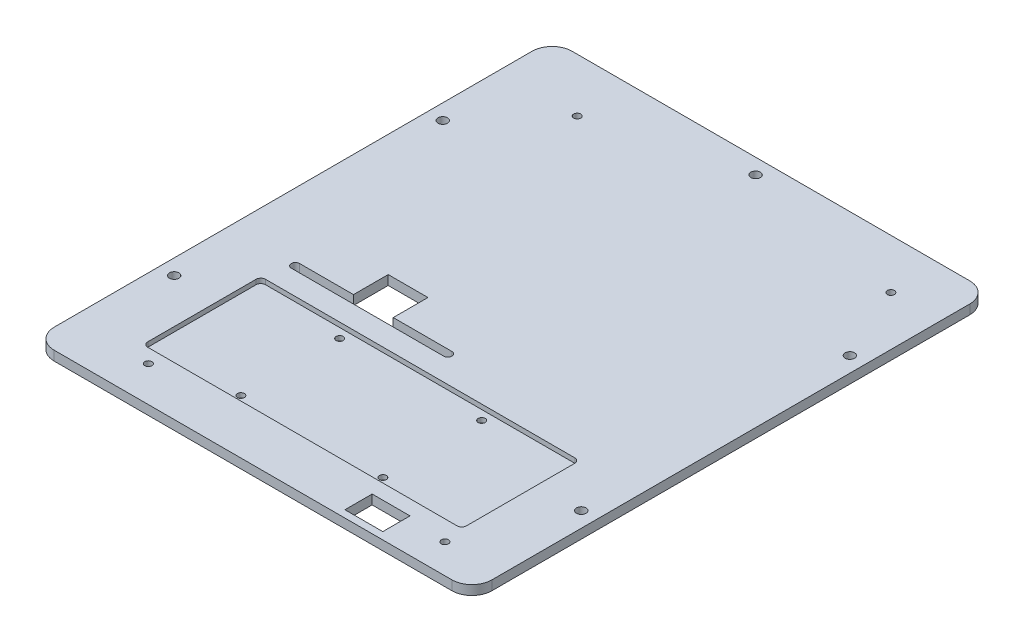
ISO-10303-21;
HEADER;
FILE_DESCRIPTION(('STEP AP214'),'2;1');
FILE_NAME('part.step','',(''),(''),'','','');
FILE_SCHEMA(('AUTOMOTIVE_DESIGN { 1 0 10303 214 1 1 1 1 }'));
ENDSEC;
DATA;
#1=APPLICATION_CONTEXT('core data for automotive mechanical design processes');
#2=APPLICATION_PROTOCOL_DEFINITION('international standard','automotive_design',2000,#1);
#3=PRODUCT_CONTEXT('',#1,'mechanical');
#4=PRODUCT('Part','Part','',(#3));
#5=PRODUCT_RELATED_PRODUCT_CATEGORY('part','',(#4));
#6=PRODUCT_DEFINITION_FORMATION('','',#4);
#7=PRODUCT_DEFINITION_CONTEXT('part definition',#1,'design');
#8=PRODUCT_DEFINITION('design','',#6,#7);
#9=PRODUCT_DEFINITION_SHAPE('','',#8);
#10=(LENGTH_UNIT() NAMED_UNIT(*) SI_UNIT(.MILLI.,.METRE.));
#11=(NAMED_UNIT(*) PLANE_ANGLE_UNIT() SI_UNIT($,.RADIAN.));
#12=(NAMED_UNIT(*) SI_UNIT($,.STERADIAN.) SOLID_ANGLE_UNIT());
#13=UNCERTAINTY_MEASURE_WITH_UNIT(LENGTH_MEASURE(1.E-05),#10,'distance_accuracy_value','');
#14=(GEOMETRIC_REPRESENTATION_CONTEXT(3) GLOBAL_UNCERTAINTY_ASSIGNED_CONTEXT((#13)) GLOBAL_UNIT_ASSIGNED_CONTEXT((#10,
#11,#12)) REPRESENTATION_CONTEXT('',''));
#15=CARTESIAN_POINT('',(0.,0.,0.));
#16=DIRECTION('',(0.,0.,1.));
#17=DIRECTION('',(1.,0.,0.));
#18=AXIS2_PLACEMENT_3D('',#15,#16,#17);
#19=CARTESIAN_POINT('',(69.6799999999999,0.,-61.38));
#20=DIRECTION('',(0.,1.,0.));
#21=DIRECTION('',(0.,0.,1.));
#22=AXIS2_PLACEMENT_3D('',#19,#20,#21);
#23=CYLINDRICAL_SURFACE('',#22,1.3);
#24=DIRECTION('',(0.,1.,0.));
#25=VECTOR('',#24,1.);
#26=CARTESIAN_POINT('',(69.6799999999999,0.,-62.68));
#27=LINE('',#26,#25);
#28=CARTESIAN_POINT('',(69.6799999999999,0.,-62.68));
#29=VERTEX_POINT('',#28);
#30=CARTESIAN_POINT('',(69.6799999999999,3.,-62.68));
#31=VERTEX_POINT('',#30);
#32=EDGE_CURVE('E501',#29,#31,#27,.T.);
#33=ORIENTED_EDGE('',*,*,#32,.F.);
#34=CARTESIAN_POINT('',(69.6799999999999,0.,-61.38));
#35=DIRECTION('',(0.,1.,0.));
#36=DIRECTION('',(0.,0.,1.));
#37=AXIS2_PLACEMENT_3D('',#34,#35,#36);
#38=CIRCLE('',#37,1.3);
#39=CARTESIAN_POINT('',(69.6799999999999,0.,-60.08));
#40=VERTEX_POINT('',#39);
#41=EDGE_CURVE('E507',#29,#40,#38,.F.);
#42=ORIENTED_EDGE('',*,*,#41,.T.);
#43=DIRECTION('',(0.,-1.,0.));
#44=VECTOR('',#43,1.);
#45=CARTESIAN_POINT('',(69.6799999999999,0.,-60.08));
#46=LINE('',#45,#44);
#47=CARTESIAN_POINT('',(69.6799999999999,3.,-60.08));
#48=VERTEX_POINT('',#47);
#49=EDGE_CURVE('E504',#48,#40,#46,.T.);
#50=ORIENTED_EDGE('',*,*,#49,.F.);
#51=CARTESIAN_POINT('',(69.6799999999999,3.,-61.38));
#52=DIRECTION('',(0.,1.,0.));
#53=DIRECTION('',(0.,0.,1.));
#54=AXIS2_PLACEMENT_3D('',#51,#52,#53);
#55=CIRCLE('',#54,1.3);
#56=EDGE_CURVE('E509',#48,#31,#55,.T.);
#57=ORIENTED_EDGE('',*,*,#56,.T.);
#58=EDGE_LOOP('',(#33,#42,#50,#57));
#59=FACE_BOUND('',#58,.T.);
#60=ADVANCED_FACE('F36',(#59),#23,.F.);
#61=CARTESIAN_POINT('',(21.3999999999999,0.,-61.38));
#62=DIRECTION('',(0.,1.,0.));
#63=DIRECTION('',(0.,0.,1.));
#64=AXIS2_PLACEMENT_3D('',#61,#62,#63);
#65=CYLINDRICAL_SURFACE('',#64,1.3);
#66=DIRECTION('',(0.,1.,0.));
#67=VECTOR('',#66,1.);
#68=CARTESIAN_POINT('',(21.3999999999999,0.,-60.08));
#69=LINE('',#68,#67);
#70=CARTESIAN_POINT('',(21.3999999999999,0.,-60.08));
#71=VERTEX_POINT('',#70);
#72=CARTESIAN_POINT('',(21.3999999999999,3.,-60.08));
#73=VERTEX_POINT('',#72);
#74=EDGE_CURVE('E491',#71,#73,#69,.T.);
#75=ORIENTED_EDGE('',*,*,#74,.F.);
#76=CARTESIAN_POINT('',(21.3999999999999,0.,-61.38));
#77=DIRECTION('',(0.,1.,0.));
#78=DIRECTION('',(0.,0.,1.));
#79=AXIS2_PLACEMENT_3D('',#76,#77,#78);
#80=CIRCLE('',#79,1.3);
#81=CARTESIAN_POINT('',(21.3999999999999,0.,-62.68));
#82=VERTEX_POINT('',#81);
#83=EDGE_CURVE('E497',#71,#82,#80,.F.);
#84=ORIENTED_EDGE('',*,*,#83,.T.);
#85=DIRECTION('',(0.,-1.,0.));
#86=VECTOR('',#85,1.);
#87=CARTESIAN_POINT('',(21.3999999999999,0.,-62.68));
#88=LINE('',#87,#86);
#89=CARTESIAN_POINT('',(21.3999999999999,3.,-62.68));
#90=VERTEX_POINT('',#89);
#91=EDGE_CURVE('E494',#90,#82,#88,.T.);
#92=ORIENTED_EDGE('',*,*,#91,.F.);
#93=CARTESIAN_POINT('',(21.3999999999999,3.,-61.38));
#94=DIRECTION('',(0.,1.,0.));
#95=DIRECTION('',(0.,0.,1.));
#96=AXIS2_PLACEMENT_3D('',#93,#94,#95);
#97=CIRCLE('',#96,1.3);
#98=EDGE_CURVE('E499',#90,#73,#97,.T.);
#99=ORIENTED_EDGE('',*,*,#98,.T.);
#100=EDGE_LOOP('',(#75,#84,#92,#99));
#101=FACE_BOUND('',#100,.T.);
#102=ADVANCED_FACE('F536',(#101),#65,.F.);
#103=CARTESIAN_POINT('',(6.35000000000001,3.,-6.34999999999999));
#104=DIRECTION('',(0.,1.,0.));
#105=DIRECTION('',(0.,0.,1.));
#106=AXIS2_PLACEMENT_3D('',#103,#104,#105);
#107=PLANE('',#106);
#108=DIRECTION('',(0.,0.,-1.));
#109=VECTOR('',#108,1.);
#110=CARTESIAN_POINT('',(108.17,3.,-2.28500000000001));
#111=LINE('',#110,#109);
#112=CARTESIAN_POINT('',(108.17,3.,-2.28500000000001));
#113=VERTEX_POINT('',#112);
#114=CARTESIAN_POINT('',(108.17,3.,-10.915));
#115=VERTEX_POINT('',#114);
#116=EDGE_CURVE('E51',#113,#115,#111,.T.);
#117=ORIENTED_EDGE('',*,*,#116,.F.);
#118=DIRECTION('',(1.,0.,0.));
#119=VECTOR('',#118,1.);
#120=CARTESIAN_POINT('',(96.17,3.,-2.28500000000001));
#121=LINE('',#120,#119);
#122=CARTESIAN_POINT('',(96.17,3.,-2.28500000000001));
#123=VERTEX_POINT('',#122);
#124=EDGE_CURVE('E240',#123,#113,#121,.T.);
#125=ORIENTED_EDGE('',*,*,#124,.F.);
#126=DIRECTION('',(0.,0.,1.));
#127=VECTOR('',#126,1.);
#128=CARTESIAN_POINT('',(96.17,3.,-2.28500000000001));
#129=LINE('',#128,#127);
#130=CARTESIAN_POINT('',(96.17,3.,-10.915));
#131=VERTEX_POINT('',#130);
#132=EDGE_CURVE('E224',#131,#123,#129,.T.);
#133=ORIENTED_EDGE('',*,*,#132,.F.);
#134=DIRECTION('',(-1.,0.,0.));
#135=VECTOR('',#134,1.);
#136=CARTESIAN_POINT('',(96.17,3.,-10.915));
#137=LINE('',#136,#135);
#138=EDGE_CURVE('E233',#115,#131,#137,.T.);
#139=ORIENTED_EDGE('',*,*,#138,.F.);
#140=EDGE_LOOP('',(#117,#125,#133,#139));
#141=FACE_BOUND('',#140,.T.);
#142=ORIENTED_EDGE('',*,*,#98,.F.);
#143=DIRECTION('',(1.,0.,0.));
#144=VECTOR('',#143,1.);
#145=CARTESIAN_POINT('',(0.,3.,-62.68));
#146=LINE('',#145,#144);
#147=CARTESIAN_POINT('',(38.49,3.,-62.68));
#148=VERTEX_POINT('',#147);
#149=EDGE_CURVE('E467',#90,#148,#146,.T.);
#150=ORIENTED_EDGE('',*,*,#149,.T.);
#151=DIRECTION('',(0.,0.,1.));
#152=VECTOR('',#151,1.);
#153=CARTESIAN_POINT('',(38.49,3.,0.));
#154=LINE('',#153,#152);
#155=CARTESIAN_POINT('',(38.49,3.,-73.68));
#156=VERTEX_POINT('',#155);
#157=EDGE_CURVE('E461',#156,#148,#154,.T.);
#158=ORIENTED_EDGE('',*,*,#157,.F.);
#159=DIRECTION('',(1.,0.,0.));
#160=VECTOR('',#159,1.);
#161=CARTESIAN_POINT('',(0.,3.,-73.68));
#162=LINE('',#161,#160);
#163=CARTESIAN_POINT('',(51.09,3.,-73.68));
#164=VERTEX_POINT('',#163);
#165=EDGE_CURVE('E420',#156,#164,#162,.T.);
#166=ORIENTED_EDGE('',*,*,#165,.T.);
#167=DIRECTION('',(0.,0.,1.));
#168=VECTOR('',#167,1.);
#169=CARTESIAN_POINT('',(51.09,3.,0.));
#170=LINE('',#169,#168);
#171=CARTESIAN_POINT('',(51.09,3.,-62.68));
#172=VERTEX_POINT('',#171);
#173=EDGE_CURVE('E285',#164,#172,#170,.T.);
#174=ORIENTED_EDGE('',*,*,#173,.T.);
#175=EDGE_CURVE('E470',#172,#31,#146,.T.);
#176=ORIENTED_EDGE('',*,*,#175,.T.);
#177=ORIENTED_EDGE('',*,*,#56,.F.);
#178=DIRECTION('',(1.,0.,0.));
#179=VECTOR('',#178,1.);
#180=CARTESIAN_POINT('',(0.,3.,-60.08));
#181=LINE('',#180,#179);
#182=EDGE_CURVE('E476',#73,#48,#181,.T.);
#183=ORIENTED_EDGE('',*,*,#182,.F.);
#184=EDGE_LOOP('',(#142,#150,#158,#166,#174,#176,#177,#183));
#185=FACE_BOUND('',#184,.T.);
#186=CARTESIAN_POINT('',(69.35,3.,-159.247561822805));
#187=DIRECTION('',(0.,1.,0.));
#188=DIRECTION('',(0.,0.,1.));
#189=AXIS2_PLACEMENT_3D('',#186,#187,#188);
#190=CIRCLE('',#189,1.5);
#191=CARTESIAN_POINT('',(69.35,3.,-157.747561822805));
#192=VERTEX_POINT('',#191);
#193=EDGE_CURVE('E445',#192,#192,#190,.T.);
#194=ORIENTED_EDGE('',*,*,#193,.F.);
#195=EDGE_LOOP('',(#194));
#196=FACE_BOUND('',#195,.T.);
#197=CARTESIAN_POINT('',(4.85332117,3.,-124.6));
#198=DIRECTION('',(0.,1.,0.));
#199=DIRECTION('',(0.,0.,1.));
#200=AXIS2_PLACEMENT_3D('',#197,#198,#199);
#201=CIRCLE('',#200,1.5);
#202=CARTESIAN_POINT('',(4.85332117,3.,-123.1));
#203=VERTEX_POINT('',#202);
#204=EDGE_CURVE('E439',#203,#203,#201,.T.);
#205=ORIENTED_EDGE('',*,*,#204,.F.);
#206=EDGE_LOOP('',(#205));
#207=FACE_BOUND('',#206,.T.);
#208=CARTESIAN_POINT('',(133.84667883,3.,-124.6));
#209=DIRECTION('',(0.,1.,0.));
#210=DIRECTION('',(0.,0.,1.));
#211=AXIS2_PLACEMENT_3D('',#208,#209,#210);
#212=CIRCLE('',#211,1.5);
#213=CARTESIAN_POINT('',(133.84667883,3.,-123.1));
#214=VERTEX_POINT('',#213);
#215=EDGE_CURVE('E433',#214,#214,#212,.T.);
#216=ORIENTED_EDGE('',*,*,#215,.F.);
#217=EDGE_LOOP('',(#216));
#218=FACE_BOUND('',#217,.T.);
#219=CARTESIAN_POINT('',(133.84667883,3.,-39.5));
#220=DIRECTION('',(0.,1.,0.));
#221=DIRECTION('',(0.,0.,1.));
#222=AXIS2_PLACEMENT_3D('',#219,#220,#221);
#223=CIRCLE('',#222,1.5);
#224=CARTESIAN_POINT('',(133.84667883,3.,-38.));
#225=VERTEX_POINT('',#224);
#226=EDGE_CURVE('E427',#225,#225,#223,.T.);
#227=ORIENTED_EDGE('',*,*,#226,.F.);
#228=EDGE_LOOP('',(#227));
#229=FACE_BOUND('',#228,.T.);
#230=CARTESIAN_POINT('',(4.85332117,3.,-39.5));
#231=DIRECTION('',(0.,1.,0.));
#232=DIRECTION('',(0.,0.,1.));
#233=AXIS2_PLACEMENT_3D('',#230,#231,#232);
#234=CIRCLE('',#233,1.5);
#235=CARTESIAN_POINT('',(4.85332117,3.,-38.));
#236=VERTEX_POINT('',#235);
#237=EDGE_CURVE('E423',#236,#236,#234,.T.);
#238=ORIENTED_EDGE('',*,*,#237,.F.);
#239=EDGE_LOOP('',(#238));
#240=FACE_BOUND('',#239,.T.);
#241=CARTESIAN_POINT('',(120.825,3.,-9.325));
#242=DIRECTION('',(0.,1.,0.));
#243=DIRECTION('',(0.,0.,1.));
#244=AXIS2_PLACEMENT_3D('',#241,#242,#243);
#245=CIRCLE('',#244,1.13029999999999);
#246=CARTESIAN_POINT('',(120.825,3.,-8.19470000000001));
#247=VERTEX_POINT('',#246);
#248=EDGE_CURVE('E417',#247,#247,#245,.T.);
#249=ORIENTED_EDGE('',*,*,#248,.F.);
#250=EDGE_LOOP('',(#249));
#251=FACE_BOUND('',#250,.T.);
#252=CARTESIAN_POINT('',(123.0602,3.,-148.39));
#253=DIRECTION('',(0.,1.,0.));
#254=DIRECTION('',(0.,0.,1.));
#255=AXIS2_PLACEMENT_3D('',#252,#253,#254);
#256=CIRCLE('',#255,1.13029999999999);
#257=CARTESIAN_POINT('',(123.0602,3.,-147.2597));
#258=VERTEX_POINT('',#257);
#259=EDGE_CURVE('E411',#258,#258,#256,.T.);
#260=ORIENTED_EDGE('',*,*,#259,.F.);
#261=EDGE_LOOP('',(#260));
#262=FACE_BOUND('',#261,.T.);
#263=CARTESIAN_POINT('',(24.94,3.,-147.12));
#264=DIRECTION('',(0.,1.,0.));
#265=DIRECTION('',(0.,0.,1.));
#266=AXIS2_PLACEMENT_3D('',#263,#264,#265);
#267=CIRCLE('',#266,1.1303);
#268=CARTESIAN_POINT('',(24.94,3.,-145.9897));
#269=VERTEX_POINT('',#268);
#270=EDGE_CURVE('E405',#269,#269,#267,.T.);
#271=ORIENTED_EDGE('',*,*,#270,.F.);
#272=EDGE_LOOP('',(#271));
#273=FACE_BOUND('',#272,.T.);
#274=CARTESIAN_POINT('',(24.94,3.,-11.23));
#275=DIRECTION('',(0.,1.,0.));
#276=DIRECTION('',(0.,0.,1.));
#277=AXIS2_PLACEMENT_3D('',#274,#275,#276);
#278=CIRCLE('',#277,1.1303);
#279=CARTESIAN_POINT('',(24.94,3.,-10.0997));
#280=VERTEX_POINT('',#279);
#281=EDGE_CURVE('E399',#280,#280,#278,.T.);
#282=ORIENTED_EDGE('',*,*,#281,.F.);
#283=EDGE_LOOP('',(#282));
#284=FACE_BOUND('',#283,.T.);
#285=CARTESIAN_POINT('',(20.35,3.,-17.13));
#286=DIRECTION('',(0.,1.,0.));
#287=DIRECTION('',(0.,0.,1.));
#288=AXIS2_PLACEMENT_3D('',#285,#286,#287);
#289=CIRCLE('',#288,1.50000000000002);
#290=CARTESIAN_POINT('',(18.8499999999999,3.,-17.13));
#291=VERTEX_POINT('',#290);
#292=CARTESIAN_POINT('',(20.35,3.,-15.63));
#293=VERTEX_POINT('',#292);
#294=EDGE_CURVE('E278',#291,#293,#289,.T.);
#295=ORIENTED_EDGE('',*,*,#294,.F.);
#296=DIRECTION('',(0.,0.,1.));
#297=VECTOR('',#296,1.);
#298=CARTESIAN_POINT('',(18.8499999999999,3.,-51.45));
#299=LINE('',#298,#297);
#300=CARTESIAN_POINT('',(18.8499999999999,3.,-51.45));
#301=VERTEX_POINT('',#300);
#302=EDGE_CURVE('E332',#301,#291,#299,.T.);
#303=ORIENTED_EDGE('',*,*,#302,.F.);
#304=CARTESIAN_POINT('',(20.35,3.,-51.45));
#305=DIRECTION('',(0.,1.,0.));
#306=DIRECTION('',(0.,0.,-1.));
#307=AXIS2_PLACEMENT_3D('',#304,#305,#306);
#308=CIRCLE('',#307,1.50000000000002);
#309=CARTESIAN_POINT('',(20.35,3.,-52.95));
#310=VERTEX_POINT('',#309);
#311=EDGE_CURVE('E329',#310,#301,#308,.T.);
#312=ORIENTED_EDGE('',*,*,#311,.F.);
#313=DIRECTION('',(-1.,0.,0.));
#314=VECTOR('',#313,1.);
#315=CARTESIAN_POINT('',(20.35,3.,-52.95));
#316=LINE('',#315,#314);
#317=CARTESIAN_POINT('',(118.35,3.,-52.95));
#318=VERTEX_POINT('',#317);
#319=EDGE_CURVE('E326',#318,#310,#316,.T.);
#320=ORIENTED_EDGE('',*,*,#319,.F.);
#321=CARTESIAN_POINT('',(118.35,3.,-51.45));
#322=DIRECTION('',(0.,1.,0.));
#323=DIRECTION('',(0.,0.,1.));
#324=AXIS2_PLACEMENT_3D('',#321,#322,#323);
#325=CIRCLE('',#324,1.50000000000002);
#326=CARTESIAN_POINT('',(119.85,3.,-51.45));
#327=VERTEX_POINT('',#326);
#328=EDGE_CURVE('E323',#327,#318,#325,.T.);
#329=ORIENTED_EDGE('',*,*,#328,.F.);
#330=DIRECTION('',(0.,0.,-1.));
#331=VECTOR('',#330,1.);
#332=CARTESIAN_POINT('',(119.85,3.,-51.45));
#333=LINE('',#332,#331);
#334=CARTESIAN_POINT('',(119.85,3.,-17.13));
#335=VERTEX_POINT('',#334);
#336=EDGE_CURVE('E320',#335,#327,#333,.T.);
#337=ORIENTED_EDGE('',*,*,#336,.F.);
#338=CARTESIAN_POINT('',(118.35,3.,-17.13));
#339=DIRECTION('',(0.,1.,0.));
#340=DIRECTION('',(0.,0.,-1.));
#341=AXIS2_PLACEMENT_3D('',#338,#339,#340);
#342=CIRCLE('',#341,1.50000000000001);
#343=CARTESIAN_POINT('',(118.35,3.,-15.63));
#344=VERTEX_POINT('',#343);
#345=EDGE_CURVE('E317',#344,#335,#342,.T.);
#346=ORIENTED_EDGE('',*,*,#345,.F.);
#347=DIRECTION('',(1.,0.,0.));
#348=VECTOR('',#347,1.);
#349=CARTESIAN_POINT('',(20.35,3.,-15.63));
#350=LINE('',#349,#348);
#351=EDGE_CURVE('E314',#293,#344,#350,.T.);
#352=ORIENTED_EDGE('',*,*,#351,.F.);
#353=EDGE_LOOP('',(#295,#303,#312,#320,#329,#337,#346,#352));
#354=FACE_BOUND('',#353,.T.);
#355=CARTESIAN_POINT('',(6.35000000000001,3.,-6.34999999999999));
#356=DIRECTION('',(0.,1.,0.));
#357=DIRECTION('',(0.,0.,1.));
#358=AXIS2_PLACEMENT_3D('',#355,#356,#357);
#359=CIRCLE('',#358,6.35);
#360=CARTESIAN_POINT('',(0.,3.,-6.34999999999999));
#361=VERTEX_POINT('',#360);
#362=CARTESIAN_POINT('',(6.35000000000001,3.,0.));
#363=VERTEX_POINT('',#362);
#364=EDGE_CURVE('E247',#361,#363,#359,.T.);
#365=ORIENTED_EDGE('',*,*,#364,.T.);
#366=DIRECTION('',(1.,0.,0.));
#367=VECTOR('',#366,1.);
#368=CARTESIAN_POINT('',(6.35000000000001,3.,0.));
#369=LINE('',#368,#367);
#370=CARTESIAN_POINT('',(132.35,3.,0.));
#371=VERTEX_POINT('',#370);
#372=EDGE_CURVE('E296',#363,#371,#369,.T.);
#373=ORIENTED_EDGE('',*,*,#372,.T.);
#374=CARTESIAN_POINT('',(132.35,3.,-6.34999999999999));
#375=DIRECTION('',(0.,1.,0.));
#376=DIRECTION('',(0.,0.,-1.));
#377=AXIS2_PLACEMENT_3D('',#374,#375,#376);
#378=CIRCLE('',#377,6.35000000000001);
#379=CARTESIAN_POINT('',(138.7,3.,-6.34999999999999));
#380=VERTEX_POINT('',#379);
#381=EDGE_CURVE('E294',#371,#380,#378,.T.);
#382=ORIENTED_EDGE('',*,*,#381,.T.);
#383=DIRECTION('',(0.,0.,-1.));
#384=VECTOR('',#383,1.);
#385=CARTESIAN_POINT('',(138.7,3.,-157.75));
#386=LINE('',#385,#384);
#387=CARTESIAN_POINT('',(138.7,3.,-157.75));
#388=VERTEX_POINT('',#387);
#389=EDGE_CURVE('E292',#380,#388,#386,.T.);
#390=ORIENTED_EDGE('',*,*,#389,.T.);
#391=CARTESIAN_POINT('',(132.35,3.,-157.75));
#392=DIRECTION('',(0.,1.,0.));
#393=DIRECTION('',(0.,0.,1.));
#394=AXIS2_PLACEMENT_3D('',#391,#392,#393);
#395=CIRCLE('',#394,6.35000000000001);
#396=CARTESIAN_POINT('',(132.35,3.,-164.1));
#397=VERTEX_POINT('',#396);
#398=EDGE_CURVE('E290',#388,#397,#395,.T.);
#399=ORIENTED_EDGE('',*,*,#398,.T.);
#400=DIRECTION('',(-1.,0.,0.));
#401=VECTOR('',#400,1.);
#402=CARTESIAN_POINT('',(6.35000000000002,3.,-164.1));
#403=LINE('',#402,#401);
#404=CARTESIAN_POINT('',(6.35000000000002,3.,-164.1));
#405=VERTEX_POINT('',#404);
#406=EDGE_CURVE('E288',#397,#405,#403,.T.);
#407=ORIENTED_EDGE('',*,*,#406,.T.);
#408=CARTESIAN_POINT('',(6.35000000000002,3.,-157.75));
#409=DIRECTION('',(0.,1.,0.));
#410=DIRECTION('',(0.,0.,-1.));
#411=AXIS2_PLACEMENT_3D('',#408,#409,#410);
#412=CIRCLE('',#411,6.35000000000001);
#413=CARTESIAN_POINT('',(0.,3.,-157.75));
#414=VERTEX_POINT('',#413);
#415=EDGE_CURVE('E286',#405,#414,#412,.T.);
#416=ORIENTED_EDGE('',*,*,#415,.T.);
#417=DIRECTION('',(0.,0.,1.));
#418=VECTOR('',#417,1.);
#419=CARTESIAN_POINT('',(0.,3.,-157.75));
#420=LINE('',#419,#418);
#421=EDGE_CURVE('E283',#414,#361,#420,.T.);
#422=ORIENTED_EDGE('',*,*,#421,.T.);
#423=EDGE_LOOP('',(#365,#373,#382,#390,#399,#407,#416,#422));
#424=FACE_BOUND('',#423,.T.);
#425=ADVANCED_FACE('F237',(#141,#185,#196,#207,#218,#229,#240,#251,#262,#273,#284,#354,#424),
#107,.T.);
#426=CARTESIAN_POINT('',(6.35000000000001,0.,-6.34999999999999));
#427=DIRECTION('',(0.,1.,0.));
#428=DIRECTION('',(0.,0.,1.));
#429=AXIS2_PLACEMENT_3D('',#426,#427,#428);
#430=PLANE('',#429);
#431=DIRECTION('',(1.,0.,0.));
#432=VECTOR('',#431,1.);
#433=CARTESIAN_POINT('',(6.35000000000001,0.,-2.28500000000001));
#434=LINE('',#433,#432);
#435=CARTESIAN_POINT('',(96.17,0.,-2.28500000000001));
#436=VERTEX_POINT('',#435);
#437=CARTESIAN_POINT('',(108.17,0.,-2.28500000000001));
#438=VERTEX_POINT('',#437);
#439=EDGE_CURVE('E44',#436,#438,#434,.T.);
#440=ORIENTED_EDGE('',*,*,#439,.T.);
#441=DIRECTION('',(0.,0.,-1.));
#442=VECTOR('',#441,1.);
#443=CARTESIAN_POINT('',(108.17,0.,-6.34999999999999));
#444=LINE('',#443,#442);
#445=CARTESIAN_POINT('',(108.17,0.,-10.915));
#446=VERTEX_POINT('',#445);
#447=EDGE_CURVE('E11',#438,#446,#444,.T.);
#448=ORIENTED_EDGE('',*,*,#447,.T.);
#449=DIRECTION('',(-1.,0.,0.));
#450=VECTOR('',#449,1.);
#451=CARTESIAN_POINT('',(6.35000000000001,0.,-10.915));
#452=LINE('',#451,#450);
#453=CARTESIAN_POINT('',(96.17,0.,-10.915));
#454=VERTEX_POINT('',#453);
#455=EDGE_CURVE('E511',#446,#454,#452,.T.);
#456=ORIENTED_EDGE('',*,*,#455,.T.);
#457=DIRECTION('',(0.,0.,1.));
#458=VECTOR('',#457,1.);
#459=CARTESIAN_POINT('',(96.17,0.,-6.34999999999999));
#460=LINE('',#459,#458);
#461=EDGE_CURVE('E227',#454,#436,#460,.T.);
#462=ORIENTED_EDGE('',*,*,#461,.T.);
#463=EDGE_LOOP('',(#440,#448,#456,#462));
#464=FACE_BOUND('',#463,.T.);
#465=ORIENTED_EDGE('',*,*,#41,.F.);
#466=DIRECTION('',(1.,0.,0.));
#467=VECTOR('',#466,1.);
#468=CARTESIAN_POINT('',(0.,0.,-62.68));
#469=LINE('',#468,#467);
#470=CARTESIAN_POINT('',(51.09,0.,-62.68));
#471=VERTEX_POINT('',#470);
#472=EDGE_CURVE('E457',#471,#29,#469,.T.);
#473=ORIENTED_EDGE('',*,*,#472,.F.);
#474=DIRECTION('',(0.,0.,1.));
#475=VECTOR('',#474,1.);
#476=CARTESIAN_POINT('',(51.09,0.,0.));
#477=LINE('',#476,#475);
#478=CARTESIAN_POINT('',(51.09,0.,-73.68));
#479=VERTEX_POINT('',#478);
#480=EDGE_CURVE('E451',#479,#471,#477,.T.);
#481=ORIENTED_EDGE('',*,*,#480,.F.);
#482=DIRECTION('',(1.,0.,0.));
#483=VECTOR('',#482,1.);
#484=CARTESIAN_POINT('',(0.,0.,-73.68));
#485=LINE('',#484,#483);
#486=CARTESIAN_POINT('',(38.49,0.,-73.68));
#487=VERTEX_POINT('',#486);
#488=EDGE_CURVE('E458',#487,#479,#485,.T.);
#489=ORIENTED_EDGE('',*,*,#488,.F.);
#490=DIRECTION('',(0.,0.,1.));
#491=VECTOR('',#490,1.);
#492=CARTESIAN_POINT('',(38.49,0.,0.));
#493=LINE('',#492,#491);
#494=CARTESIAN_POINT('',(38.49,0.,-62.68));
#495=VERTEX_POINT('',#494);
#496=EDGE_CURVE('E377',#487,#495,#493,.T.);
#497=ORIENTED_EDGE('',*,*,#496,.T.);
#498=EDGE_CURVE('E479',#82,#495,#469,.T.);
#499=ORIENTED_EDGE('',*,*,#498,.F.);
#500=ORIENTED_EDGE('',*,*,#83,.F.);
#501=DIRECTION('',(1.,0.,0.));
#502=VECTOR('',#501,1.);
#503=CARTESIAN_POINT('',(0.,0.,-60.08));
#504=LINE('',#503,#502);
#505=EDGE_CURVE('E309',#71,#40,#504,.T.);
#506=ORIENTED_EDGE('',*,*,#505,.T.);
#507=EDGE_LOOP('',(#465,#473,#481,#489,#497,#499,#500,#506));
#508=FACE_BOUND('',#507,.T.);
#509=CARTESIAN_POINT('',(69.35,0.,-159.247561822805));
#510=DIRECTION('',(0.,1.,0.));
#511=DIRECTION('',(0.,0.,1.));
#512=AXIS2_PLACEMENT_3D('',#509,#510,#511);
#513=CIRCLE('',#512,1.5);
#514=CARTESIAN_POINT('',(69.35,0.,-157.747561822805));
#515=VERTEX_POINT('',#514);
#516=EDGE_CURVE('E448',#515,#515,#513,.F.);
#517=ORIENTED_EDGE('',*,*,#516,.F.);
#518=EDGE_LOOP('',(#517));
#519=FACE_BOUND('',#518,.T.);
#520=CARTESIAN_POINT('',(4.85332117,0.,-124.6));
#521=DIRECTION('',(0.,1.,0.));
#522=DIRECTION('',(0.,0.,1.));
#523=AXIS2_PLACEMENT_3D('',#520,#521,#522);
#524=CIRCLE('',#523,1.5);
#525=CARTESIAN_POINT('',(4.85332117,0.,-123.1));
#526=VERTEX_POINT('',#525);
#527=EDGE_CURVE('E442',#526,#526,#524,.F.);
#528=ORIENTED_EDGE('',*,*,#527,.F.);
#529=EDGE_LOOP('',(#528));
#530=FACE_BOUND('',#529,.T.);
#531=CARTESIAN_POINT('',(133.84667883,0.,-124.6));
#532=DIRECTION('',(0.,1.,0.));
#533=DIRECTION('',(0.,0.,1.));
#534=AXIS2_PLACEMENT_3D('',#531,#532,#533);
#535=CIRCLE('',#534,1.5);
#536=CARTESIAN_POINT('',(133.84667883,0.,-123.1));
#537=VERTEX_POINT('',#536);
#538=EDGE_CURVE('E436',#537,#537,#535,.F.);
#539=ORIENTED_EDGE('',*,*,#538,.F.);
#540=EDGE_LOOP('',(#539));
#541=FACE_BOUND('',#540,.T.);
#542=CARTESIAN_POINT('',(133.84667883,0.,-39.5));
#543=DIRECTION('',(0.,1.,0.));
#544=DIRECTION('',(0.,0.,1.));
#545=AXIS2_PLACEMENT_3D('',#542,#543,#544);
#546=CIRCLE('',#545,1.5);
#547=CARTESIAN_POINT('',(133.84667883,0.,-38.));
#548=VERTEX_POINT('',#547);
#549=EDGE_CURVE('E430',#548,#548,#546,.F.);
#550=ORIENTED_EDGE('',*,*,#549,.F.);
#551=EDGE_LOOP('',(#550));
#552=FACE_BOUND('',#551,.T.);
#553=CARTESIAN_POINT('',(4.85332117,0.,-39.5));
#554=DIRECTION('',(0.,1.,0.));
#555=DIRECTION('',(0.,0.,1.));
#556=AXIS2_PLACEMENT_3D('',#553,#554,#555);
#557=CIRCLE('',#556,1.5);
#558=CARTESIAN_POINT('',(4.85332117,0.,-38.));
#559=VERTEX_POINT('',#558);
#560=EDGE_CURVE('E424',#559,#559,#557,.F.);
#561=ORIENTED_EDGE('',*,*,#560,.F.);
#562=EDGE_LOOP('',(#561));
#563=FACE_BOUND('',#562,.T.);
#564=CARTESIAN_POINT('',(120.825,0.,-9.325));
#565=DIRECTION('',(0.,1.,0.));
#566=DIRECTION('',(0.,0.,1.));
#567=AXIS2_PLACEMENT_3D('',#564,#565,#566);
#568=CIRCLE('',#567,1.13029999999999);
#569=CARTESIAN_POINT('',(120.825,0.,-8.19470000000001));
#570=VERTEX_POINT('',#569);
#571=EDGE_CURVE('E414',#570,#570,#568,.T.);
#572=ORIENTED_EDGE('',*,*,#571,.T.);
#573=EDGE_LOOP('',(#572));
#574=FACE_BOUND('',#573,.T.);
#575=CARTESIAN_POINT('',(123.0602,0.,-148.39));
#576=DIRECTION('',(0.,1.,0.));
#577=DIRECTION('',(0.,0.,1.));
#578=AXIS2_PLACEMENT_3D('',#575,#576,#577);
#579=CIRCLE('',#578,1.13029999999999);
#580=CARTESIAN_POINT('',(123.0602,0.,-147.2597));
#581=VERTEX_POINT('',#580);
#582=EDGE_CURVE('E408',#581,#581,#579,.T.);
#583=ORIENTED_EDGE('',*,*,#582,.T.);
#584=EDGE_LOOP('',(#583));
#585=FACE_BOUND('',#584,.T.);
#586=CARTESIAN_POINT('',(24.94,0.,-147.12));
#587=DIRECTION('',(0.,1.,0.));
#588=DIRECTION('',(0.,0.,1.));
#589=AXIS2_PLACEMENT_3D('',#586,#587,#588);
#590=CIRCLE('',#589,1.1303);
#591=CARTESIAN_POINT('',(24.94,0.,-145.9897));
#592=VERTEX_POINT('',#591);
#593=EDGE_CURVE('E402',#592,#592,#590,.T.);
#594=ORIENTED_EDGE('',*,*,#593,.T.);
#595=EDGE_LOOP('',(#594));
#596=FACE_BOUND('',#595,.T.);
#597=CARTESIAN_POINT('',(24.94,0.,-11.23));
#598=DIRECTION('',(0.,1.,0.));
#599=DIRECTION('',(0.,0.,1.));
#600=AXIS2_PLACEMENT_3D('',#597,#598,#599);
#601=CIRCLE('',#600,1.1303);
#602=CARTESIAN_POINT('',(24.94,0.,-10.0997));
#603=VERTEX_POINT('',#602);
#604=EDGE_CURVE('E396',#603,#603,#601,.T.);
#605=ORIENTED_EDGE('',*,*,#604,.T.);
#606=EDGE_LOOP('',(#605));
#607=FACE_BOUND('',#606,.T.);
#608=CARTESIAN_POINT('',(91.85,0.,-49.95));
#609=DIRECTION('',(0.,1.,0.));
#610=DIRECTION('',(0.,0.,-1.));
#611=AXIS2_PLACEMENT_3D('',#608,#609,#610);
#612=CIRCLE('',#611,1.12999999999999);
#613=CARTESIAN_POINT('',(91.85,0.,-51.08));
#614=VERTEX_POINT('',#613);
#615=EDGE_CURVE('E390',#614,#614,#612,.T.);
#616=ORIENTED_EDGE('',*,*,#615,.T.);
#617=EDGE_LOOP('',(#616));
#618=FACE_BOUND('',#617,.T.);
#619=CARTESIAN_POINT('',(91.85,0.,-18.63));
#620=DIRECTION('',(0.,1.,0.));
#621=DIRECTION('',(0.,0.,-1.));
#622=AXIS2_PLACEMENT_3D('',#619,#620,#621);
#623=CIRCLE('',#622,1.13);
#624=CARTESIAN_POINT('',(91.85,0.,-19.76));
#625=VERTEX_POINT('',#624);
#626=EDGE_CURVE('E384',#625,#625,#623,.T.);
#627=ORIENTED_EDGE('',*,*,#626,.T.);
#628=EDGE_LOOP('',(#627));
#629=FACE_BOUND('',#628,.T.);
#630=CARTESIAN_POINT('',(46.85,0.,-49.95));
#631=DIRECTION('',(0.,1.,0.));
#632=DIRECTION('',(0.,0.,1.));
#633=AXIS2_PLACEMENT_3D('',#630,#631,#632);
#634=CIRCLE('',#633,1.13);
#635=CARTESIAN_POINT('',(46.85,0.,-48.82));
#636=VERTEX_POINT('',#635);
#637=EDGE_CURVE('E378',#636,#636,#634,.T.);
#638=ORIENTED_EDGE('',*,*,#637,.T.);
#639=EDGE_LOOP('',(#638));
#640=FACE_BOUND('',#639,.T.);
#641=CARTESIAN_POINT('',(46.85,0.,-18.63));
#642=DIRECTION('',(0.,1.,0.));
#643=DIRECTION('',(0.,0.,1.));
#644=AXIS2_PLACEMENT_3D('',#641,#642,#643);
#645=CIRCLE('',#644,1.13);
#646=CARTESIAN_POINT('',(46.85,0.,-17.5));
#647=VERTEX_POINT('',#646);
#648=EDGE_CURVE('E374',#647,#647,#645,.T.);
#649=ORIENTED_EDGE('',*,*,#648,.T.);
#650=EDGE_LOOP('',(#649));
#651=FACE_BOUND('',#650,.T.);
#652=CARTESIAN_POINT('',(6.35000000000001,0.,-6.34999999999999));
#653=DIRECTION('',(0.,1.,0.));
#654=DIRECTION('',(0.,0.,1.));
#655=AXIS2_PLACEMENT_3D('',#652,#653,#654);
#656=CIRCLE('',#655,6.35);
#657=CARTESIAN_POINT('',(0.,0.,-6.34999999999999));
#658=VERTEX_POINT('',#657);
#659=CARTESIAN_POINT('',(6.35000000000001,0.,0.));
#660=VERTEX_POINT('',#659);
#661=EDGE_CURVE('E282',#658,#660,#656,.T.);
#662=ORIENTED_EDGE('',*,*,#661,.F.);
#663=DIRECTION('',(0.,0.,1.));
#664=VECTOR('',#663,1.);
#665=CARTESIAN_POINT('',(0.,0.,-157.75));
#666=LINE('',#665,#664);
#667=CARTESIAN_POINT('',(0.,0.,-157.75));
#668=VERTEX_POINT('',#667);
#669=EDGE_CURVE('E274',#668,#658,#666,.T.);
#670=ORIENTED_EDGE('',*,*,#669,.F.);
#671=CARTESIAN_POINT('',(6.35000000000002,0.,-157.75));
#672=DIRECTION('',(0.,1.,0.));
#673=DIRECTION('',(0.,0.,-1.));
#674=AXIS2_PLACEMENT_3D('',#671,#672,#673);
#675=CIRCLE('',#674,6.35000000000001);
#676=CARTESIAN_POINT('',(6.35000000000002,0.,-164.1));
#677=VERTEX_POINT('',#676);
#678=EDGE_CURVE('E270',#677,#668,#675,.T.);
#679=ORIENTED_EDGE('',*,*,#678,.F.);
#680=DIRECTION('',(-1.,0.,0.));
#681=VECTOR('',#680,1.);
#682=CARTESIAN_POINT('',(6.35000000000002,0.,-164.1));
#683=LINE('',#682,#681);
#684=CARTESIAN_POINT('',(132.35,0.,-164.1));
#685=VERTEX_POINT('',#684);
#686=EDGE_CURVE('E266',#685,#677,#683,.T.);
#687=ORIENTED_EDGE('',*,*,#686,.F.);
#688=CARTESIAN_POINT('',(132.35,0.,-157.75));
#689=DIRECTION('',(0.,1.,0.));
#690=DIRECTION('',(0.,0.,1.));
#691=AXIS2_PLACEMENT_3D('',#688,#689,#690);
#692=CIRCLE('',#691,6.35000000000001);
#693=CARTESIAN_POINT('',(138.7,0.,-157.75));
#694=VERTEX_POINT('',#693);
#695=EDGE_CURVE('E262',#694,#685,#692,.T.);
#696=ORIENTED_EDGE('',*,*,#695,.F.);
#697=DIRECTION('',(0.,0.,-1.));
#698=VECTOR('',#697,1.);
#699=CARTESIAN_POINT('',(138.7,0.,-157.75));
#700=LINE('',#699,#698);
#701=CARTESIAN_POINT('',(138.7,0.,-6.34999999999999));
#702=VERTEX_POINT('',#701);
#703=EDGE_CURVE('E258',#702,#694,#700,.T.);
#704=ORIENTED_EDGE('',*,*,#703,.F.);
#705=CARTESIAN_POINT('',(132.35,0.,-6.34999999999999));
#706=DIRECTION('',(0.,1.,0.));
#707=DIRECTION('',(0.,0.,-1.));
#708=AXIS2_PLACEMENT_3D('',#705,#706,#707);
#709=CIRCLE('',#708,6.35000000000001);
#710=CARTESIAN_POINT('',(132.35,0.,0.));
#711=VERTEX_POINT('',#710);
#712=EDGE_CURVE('E253',#711,#702,#709,.T.);
#713=ORIENTED_EDGE('',*,*,#712,.F.);
#714=DIRECTION('',(1.,0.,0.));
#715=VECTOR('',#714,1.);
#716=CARTESIAN_POINT('',(6.35000000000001,0.,0.));
#717=LINE('',#716,#715);
#718=EDGE_CURVE('E254',#660,#711,#717,.T.);
#719=ORIENTED_EDGE('',*,*,#718,.F.);
#720=EDGE_LOOP('',(#662,#670,#679,#687,#696,#704,#713,#719));
#721=FACE_BOUND('',#720,.T.);
#722=ADVANCED_FACE('F515',(#464,#508,#519,#530,#541,#552,#563,#574,#585,#596,#607,#618,#629,
#640,#651,#721),#430,.F.);
#723=CARTESIAN_POINT('',(6.35000000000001,3.,-6.34999999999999));
#724=DIRECTION('',(0.,-1.,0.));
#725=DIRECTION('',(0.,0.,-1.));
#726=AXIS2_PLACEMENT_3D('',#723,#724,#725);
#727=CYLINDRICAL_SURFACE('',#726,6.35);
#728=ORIENTED_EDGE('',*,*,#661,.T.);
#729=DIRECTION('',(0.,-1.,0.));
#730=VECTOR('',#729,1.);
#731=CARTESIAN_POINT('',(6.35000000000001,3.,0.));
#732=LINE('',#731,#730);
#733=EDGE_CURVE('E250',#363,#660,#732,.T.);
#734=ORIENTED_EDGE('',*,*,#733,.F.);
#735=ORIENTED_EDGE('',*,*,#364,.F.);
#736=DIRECTION('',(0.,-1.,0.));
#737=VECTOR('',#736,1.);
#738=CARTESIAN_POINT('',(0.,3.,-6.34999999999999));
#739=LINE('',#738,#737);
#740=EDGE_CURVE('E279',#361,#658,#739,.T.);
#741=ORIENTED_EDGE('',*,*,#740,.T.);
#742=EDGE_LOOP('',(#728,#734,#735,#741));
#743=FACE_BOUND('',#742,.T.);
#744=ADVANCED_FACE('F582',(#743),#727,.T.);
#745=CARTESIAN_POINT('',(6.35000000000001,3.,0.));
#746=DIRECTION('',(0.,0.,-1.));
#747=DIRECTION('',(-1.,0.,0.));
#748=AXIS2_PLACEMENT_3D('',#745,#746,#747);
#749=PLANE('',#748);
#750=ORIENTED_EDGE('',*,*,#718,.T.);
#751=DIRECTION('',(0.,-1.,0.));
#752=VECTOR('',#751,1.);
#753=CARTESIAN_POINT('',(132.35,3.,0.));
#754=LINE('',#753,#752);
#755=EDGE_CURVE('E255',#371,#711,#754,.T.);
#756=ORIENTED_EDGE('',*,*,#755,.F.);
#757=ORIENTED_EDGE('',*,*,#372,.F.);
#758=ORIENTED_EDGE('',*,*,#733,.T.);
#759=EDGE_LOOP('',(#750,#756,#757,#758));
#760=FACE_BOUND('',#759,.T.);
#761=ADVANCED_FACE('F604',(#760),#749,.F.);
#762=CARTESIAN_POINT('',(132.35,3.,-6.34999999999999));
#763=DIRECTION('',(0.,-1.,0.));
#764=DIRECTION('',(0.,0.,-1.));
#765=AXIS2_PLACEMENT_3D('',#762,#763,#764);
#766=CYLINDRICAL_SURFACE('',#765,6.35000000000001);
#767=ORIENTED_EDGE('',*,*,#712,.T.);
#768=DIRECTION('',(0.,-1.,0.));
#769=VECTOR('',#768,1.);
#770=CARTESIAN_POINT('',(138.7,3.,-6.34999999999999));
#771=LINE('',#770,#769);
#772=EDGE_CURVE('E259',#380,#702,#771,.T.);
#773=ORIENTED_EDGE('',*,*,#772,.F.);
#774=ORIENTED_EDGE('',*,*,#381,.F.);
#775=ORIENTED_EDGE('',*,*,#755,.T.);
#776=EDGE_LOOP('',(#767,#773,#774,#775));
#777=FACE_BOUND('',#776,.T.);
#778=ADVANCED_FACE('F611',(#777),#766,.T.);
#779=CARTESIAN_POINT('',(138.7,3.,-157.75));
#780=DIRECTION('',(-1.,0.,0.));
#781=DIRECTION('',(0.,0.,1.));
#782=AXIS2_PLACEMENT_3D('',#779,#780,#781);
#783=PLANE('',#782);
#784=ORIENTED_EDGE('',*,*,#703,.T.);
#785=DIRECTION('',(0.,-1.,0.));
#786=VECTOR('',#785,1.);
#787=CARTESIAN_POINT('',(138.7,3.,-157.75));
#788=LINE('',#787,#786);
#789=EDGE_CURVE('E263',#388,#694,#788,.T.);
#790=ORIENTED_EDGE('',*,*,#789,.F.);
#791=ORIENTED_EDGE('',*,*,#389,.F.);
#792=ORIENTED_EDGE('',*,*,#772,.T.);
#793=EDGE_LOOP('',(#784,#790,#791,#792));
#794=FACE_BOUND('',#793,.T.);
#795=ADVANCED_FACE('F619',(#794),#783,.F.);
#796=CARTESIAN_POINT('',(132.35,3.,-157.75));
#797=DIRECTION('',(0.,-1.,0.));
#798=DIRECTION('',(0.,0.,-1.));
#799=AXIS2_PLACEMENT_3D('',#796,#797,#798);
#800=CYLINDRICAL_SURFACE('',#799,6.35000000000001);
#801=ORIENTED_EDGE('',*,*,#695,.T.);
#802=DIRECTION('',(0.,-1.,0.));
#803=VECTOR('',#802,1.);
#804=CARTESIAN_POINT('',(132.35,3.,-164.1));
#805=LINE('',#804,#803);
#806=EDGE_CURVE('E267',#397,#685,#805,.T.);
#807=ORIENTED_EDGE('',*,*,#806,.F.);
#808=ORIENTED_EDGE('',*,*,#398,.F.);
#809=ORIENTED_EDGE('',*,*,#789,.T.);
#810=EDGE_LOOP('',(#801,#807,#808,#809));
#811=FACE_BOUND('',#810,.T.);
#812=ADVANCED_FACE('F627',(#811),#800,.T.);
#813=CARTESIAN_POINT('',(6.35000000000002,3.,-164.1));
#814=DIRECTION('',(0.,0.,1.));
#815=DIRECTION('',(1.,0.,0.));
#816=AXIS2_PLACEMENT_3D('',#813,#814,#815);
#817=PLANE('',#816);
#818=ORIENTED_EDGE('',*,*,#686,.T.);
#819=DIRECTION('',(0.,-1.,0.));
#820=VECTOR('',#819,1.);
#821=CARTESIAN_POINT('',(6.35000000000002,3.,-164.1));
#822=LINE('',#821,#820);
#823=EDGE_CURVE('E271',#405,#677,#822,.T.);
#824=ORIENTED_EDGE('',*,*,#823,.F.);
#825=ORIENTED_EDGE('',*,*,#406,.F.);
#826=ORIENTED_EDGE('',*,*,#806,.T.);
#827=EDGE_LOOP('',(#818,#824,#825,#826));
#828=FACE_BOUND('',#827,.T.);
#829=ADVANCED_FACE('F635',(#828),#817,.F.);
#830=CARTESIAN_POINT('',(6.35000000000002,3.,-157.75));
#831=DIRECTION('',(0.,-1.,0.));
#832=DIRECTION('',(0.,0.,-1.));
#833=AXIS2_PLACEMENT_3D('',#830,#831,#832);
#834=CYLINDRICAL_SURFACE('',#833,6.35000000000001);
#835=ORIENTED_EDGE('',*,*,#678,.T.);
#836=DIRECTION('',(0.,-1.,0.));
#837=VECTOR('',#836,1.);
#838=CARTESIAN_POINT('',(0.,3.,-157.75));
#839=LINE('',#838,#837);
#840=EDGE_CURVE('E275',#414,#668,#839,.T.);
#841=ORIENTED_EDGE('',*,*,#840,.F.);
#842=ORIENTED_EDGE('',*,*,#415,.F.);
#843=ORIENTED_EDGE('',*,*,#823,.T.);
#844=EDGE_LOOP('',(#835,#841,#842,#843));
#845=FACE_BOUND('',#844,.T.);
#846=ADVANCED_FACE('F643',(#845),#834,.T.);
#847=CARTESIAN_POINT('',(0.,3.,-157.75));
#848=DIRECTION('',(1.,0.,0.));
#849=DIRECTION('',(0.,0.,-1.));
#850=AXIS2_PLACEMENT_3D('',#847,#848,#849);
#851=PLANE('',#850);
#852=ORIENTED_EDGE('',*,*,#669,.T.);
#853=ORIENTED_EDGE('',*,*,#740,.F.);
#854=ORIENTED_EDGE('',*,*,#421,.F.);
#855=ORIENTED_EDGE('',*,*,#840,.T.);
#856=EDGE_LOOP('',(#852,#853,#854,#855));
#857=FACE_BOUND('',#856,.T.);
#858=ADVANCED_FACE('F651',(#857),#851,.F.);
#859=CARTESIAN_POINT('',(20.35,1.5,-17.13));
#860=DIRECTION('',(0.,1.,0.));
#861=DIRECTION('',(0.,0.,1.));
#862=AXIS2_PLACEMENT_3D('',#859,#860,#861);
#863=CYLINDRICAL_SURFACE('',#862,1.50000000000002);
#864=ORIENTED_EDGE('',*,*,#294,.T.);
#865=DIRECTION('',(0.,1.,0.));
#866=VECTOR('',#865,1.);
#867=CARTESIAN_POINT('',(20.35,1.5,-15.63));
#868=LINE('',#867,#866);
#869=CARTESIAN_POINT('',(20.35,1.5,-15.63));
#870=VERTEX_POINT('',#869);
#871=EDGE_CURVE('E310',#870,#293,#868,.T.);
#872=ORIENTED_EDGE('',*,*,#871,.F.);
#873=CARTESIAN_POINT('',(20.35,1.5,-17.13));
#874=DIRECTION('',(0.,1.,0.));
#875=DIRECTION('',(0.,0.,1.));
#876=AXIS2_PLACEMENT_3D('',#873,#874,#875);
#877=CIRCLE('',#876,1.50000000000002);
#878=CARTESIAN_POINT('',(18.8499999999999,1.5,-17.13));
#879=VERTEX_POINT('',#878);
#880=EDGE_CURVE('E313',#879,#870,#877,.T.);
#881=ORIENTED_EDGE('',*,*,#880,.F.);
#882=DIRECTION('',(0.,1.,0.));
#883=VECTOR('',#882,1.);
#884=CARTESIAN_POINT('',(18.8499999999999,1.5,-17.13));
#885=LINE('',#884,#883);
#886=EDGE_CURVE('E333',#879,#291,#885,.T.);
#887=ORIENTED_EDGE('',*,*,#886,.T.);
#888=EDGE_LOOP('',(#864,#872,#881,#887));
#889=FACE_BOUND('',#888,.T.);
#890=ADVANCED_FACE('F659',(#889),#863,.F.);
#891=CARTESIAN_POINT('',(18.8499999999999,1.5,-51.45));
#892=DIRECTION('',(-1.,0.,0.));
#893=DIRECTION('',(0.,0.,1.));
#894=AXIS2_PLACEMENT_3D('',#891,#892,#893);
#895=PLANE('',#894);
#896=ORIENTED_EDGE('',*,*,#302,.T.);
#897=ORIENTED_EDGE('',*,*,#886,.F.);
#898=DIRECTION('',(0.,0.,1.));
#899=VECTOR('',#898,1.);
#900=CARTESIAN_POINT('',(18.8499999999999,1.5,-51.45));
#901=LINE('',#900,#899);
#902=CARTESIAN_POINT('',(18.8499999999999,1.5,-51.45));
#903=VERTEX_POINT('',#902);
#904=EDGE_CURVE('E335',#903,#879,#901,.T.);
#905=ORIENTED_EDGE('',*,*,#904,.F.);
#906=DIRECTION('',(0.,1.,0.));
#907=VECTOR('',#906,1.);
#908=CARTESIAN_POINT('',(18.8499999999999,1.5,-51.45));
#909=LINE('',#908,#907);
#910=EDGE_CURVE('E330',#903,#301,#909,.T.);
#911=ORIENTED_EDGE('',*,*,#910,.T.);
#912=EDGE_LOOP('',(#896,#897,#905,#911));
#913=FACE_BOUND('',#912,.T.);
#914=ADVANCED_FACE('F667',(#913),#895,.F.);
#915=CARTESIAN_POINT('',(20.35,1.5,-51.45));
#916=DIRECTION('',(0.,1.,0.));
#917=DIRECTION('',(0.,0.,1.));
#918=AXIS2_PLACEMENT_3D('',#915,#916,#917);
#919=CYLINDRICAL_SURFACE('',#918,1.50000000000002);
#920=ORIENTED_EDGE('',*,*,#311,.T.);
#921=ORIENTED_EDGE('',*,*,#910,.F.);
#922=CARTESIAN_POINT('',(20.35,1.5,-51.45));
#923=DIRECTION('',(0.,1.,0.));
#924=DIRECTION('',(0.,0.,-1.));
#925=AXIS2_PLACEMENT_3D('',#922,#923,#924);
#926=CIRCLE('',#925,1.50000000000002);
#927=CARTESIAN_POINT('',(20.35,1.5,-52.95));
#928=VERTEX_POINT('',#927);
#929=EDGE_CURVE('E339',#928,#903,#926,.T.);
#930=ORIENTED_EDGE('',*,*,#929,.F.);
#931=DIRECTION('',(0.,1.,0.));
#932=VECTOR('',#931,1.);
#933=CARTESIAN_POINT('',(20.35,1.5,-52.95));
#934=LINE('',#933,#932);
#935=EDGE_CURVE('E327',#928,#310,#934,.T.);
#936=ORIENTED_EDGE('',*,*,#935,.T.);
#937=EDGE_LOOP('',(#920,#921,#930,#936));
#938=FACE_BOUND('',#937,.T.);
#939=ADVANCED_FACE('F675',(#938),#919,.F.);
#940=CARTESIAN_POINT('',(20.35,1.5,-52.95));
#941=DIRECTION('',(0.,0.,-1.));
#942=DIRECTION('',(-1.,0.,0.));
#943=AXIS2_PLACEMENT_3D('',#940,#941,#942);
#944=PLANE('',#943);
#945=ORIENTED_EDGE('',*,*,#319,.T.);
#946=ORIENTED_EDGE('',*,*,#935,.F.);
#947=DIRECTION('',(-1.,0.,0.));
#948=VECTOR('',#947,1.);
#949=CARTESIAN_POINT('',(20.35,1.5,-52.95));
#950=LINE('',#949,#948);
#951=CARTESIAN_POINT('',(118.35,1.5,-52.95));
#952=VERTEX_POINT('',#951);
#953=EDGE_CURVE('E342',#952,#928,#950,.T.);
#954=ORIENTED_EDGE('',*,*,#953,.F.);
#955=DIRECTION('',(0.,1.,0.));
#956=VECTOR('',#955,1.);
#957=CARTESIAN_POINT('',(118.35,1.5,-52.95));
#958=LINE('',#957,#956);
#959=EDGE_CURVE('E324',#952,#318,#958,.T.);
#960=ORIENTED_EDGE('',*,*,#959,.T.);
#961=EDGE_LOOP('',(#945,#946,#954,#960));
#962=FACE_BOUND('',#961,.T.);
#963=ADVANCED_FACE('F683',(#962),#944,.F.);
#964=CARTESIAN_POINT('',(118.35,1.5,-51.45));
#965=DIRECTION('',(0.,1.,0.));
#966=DIRECTION('',(0.,0.,1.));
#967=AXIS2_PLACEMENT_3D('',#964,#965,#966);
#968=CYLINDRICAL_SURFACE('',#967,1.50000000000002);
#969=ORIENTED_EDGE('',*,*,#328,.T.);
#970=ORIENTED_EDGE('',*,*,#959,.F.);
#971=CARTESIAN_POINT('',(118.35,1.5,-51.45));
#972=DIRECTION('',(0.,1.,0.));
#973=DIRECTION('',(0.,0.,1.));
#974=AXIS2_PLACEMENT_3D('',#971,#972,#973);
#975=CIRCLE('',#974,1.50000000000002);
#976=CARTESIAN_POINT('',(119.85,1.5,-51.45));
#977=VERTEX_POINT('',#976);
#978=EDGE_CURVE('E345',#977,#952,#975,.T.);
#979=ORIENTED_EDGE('',*,*,#978,.F.);
#980=DIRECTION('',(0.,1.,0.));
#981=VECTOR('',#980,1.);
#982=CARTESIAN_POINT('',(119.85,1.5,-51.45));
#983=LINE('',#982,#981);
#984=EDGE_CURVE('E321',#977,#327,#983,.T.);
#985=ORIENTED_EDGE('',*,*,#984,.T.);
#986=EDGE_LOOP('',(#969,#970,#979,#985));
#987=FACE_BOUND('',#986,.T.);
#988=ADVANCED_FACE('F691',(#987),#968,.F.);
#989=CARTESIAN_POINT('',(119.85,1.5,-51.45));
#990=DIRECTION('',(1.,0.,0.));
#991=DIRECTION('',(0.,0.,-1.));
#992=AXIS2_PLACEMENT_3D('',#989,#990,#991);
#993=PLANE('',#992);
#994=ORIENTED_EDGE('',*,*,#336,.T.);
#995=ORIENTED_EDGE('',*,*,#984,.F.);
#996=DIRECTION('',(0.,0.,-1.));
#997=VECTOR('',#996,1.);
#998=CARTESIAN_POINT('',(119.85,1.5,-51.45));
#999=LINE('',#998,#997);
#1000=CARTESIAN_POINT('',(119.85,1.5,-17.13));
#1001=VERTEX_POINT('',#1000);
#1002=EDGE_CURVE('E348',#1001,#977,#999,.T.);
#1003=ORIENTED_EDGE('',*,*,#1002,.F.);
#1004=DIRECTION('',(0.,1.,0.));
#1005=VECTOR('',#1004,1.);
#1006=CARTESIAN_POINT('',(119.85,1.5,-17.13));
#1007=LINE('',#1006,#1005);
#1008=EDGE_CURVE('E318',#1001,#335,#1007,.T.);
#1009=ORIENTED_EDGE('',*,*,#1008,.T.);
#1010=EDGE_LOOP('',(#994,#995,#1003,#1009));
#1011=FACE_BOUND('',#1010,.T.);
#1012=ADVANCED_FACE('F699',(#1011),#993,.F.);
#1013=CARTESIAN_POINT('',(118.35,1.5,-17.13));
#1014=DIRECTION('',(0.,1.,0.));
#1015=DIRECTION('',(0.,0.,1.));
#1016=AXIS2_PLACEMENT_3D('',#1013,#1014,#1015);
#1017=CYLINDRICAL_SURFACE('',#1016,1.50000000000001);
#1018=ORIENTED_EDGE('',*,*,#345,.T.);
#1019=ORIENTED_EDGE('',*,*,#1008,.F.);
#1020=CARTESIAN_POINT('',(118.35,1.5,-17.13));
#1021=DIRECTION('',(0.,1.,0.));
#1022=DIRECTION('',(0.,0.,-1.));
#1023=AXIS2_PLACEMENT_3D('',#1020,#1021,#1022);
#1024=CIRCLE('',#1023,1.50000000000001);
#1025=CARTESIAN_POINT('',(118.35,1.5,-15.63));
#1026=VERTEX_POINT('',#1025);
#1027=EDGE_CURVE('E351',#1026,#1001,#1024,.T.);
#1028=ORIENTED_EDGE('',*,*,#1027,.F.);
#1029=DIRECTION('',(0.,1.,0.));
#1030=VECTOR('',#1029,1.);
#1031=CARTESIAN_POINT('',(118.35,1.5,-15.63));
#1032=LINE('',#1031,#1030);
#1033=EDGE_CURVE('E315',#1026,#344,#1032,.T.);
#1034=ORIENTED_EDGE('',*,*,#1033,.T.);
#1035=EDGE_LOOP('',(#1018,#1019,#1028,#1034));
#1036=FACE_BOUND('',#1035,.T.);
#1037=ADVANCED_FACE('F707',(#1036),#1017,.F.);
#1038=CARTESIAN_POINT('',(20.35,1.5,-15.63));
#1039=DIRECTION('',(0.,0.,1.));
#1040=DIRECTION('',(1.,0.,0.));
#1041=AXIS2_PLACEMENT_3D('',#1038,#1039,#1040);
#1042=PLANE('',#1041);
#1043=ORIENTED_EDGE('',*,*,#351,.T.);
#1044=ORIENTED_EDGE('',*,*,#1033,.F.);
#1045=DIRECTION('',(1.,0.,0.));
#1046=VECTOR('',#1045,1.);
#1047=CARTESIAN_POINT('',(20.35,1.5,-15.63));
#1048=LINE('',#1047,#1046);
#1049=EDGE_CURVE('E354',#870,#1026,#1048,.T.);
#1050=ORIENTED_EDGE('',*,*,#1049,.F.);
#1051=ORIENTED_EDGE('',*,*,#871,.T.);
#1052=EDGE_LOOP('',(#1043,#1044,#1050,#1051));
#1053=FACE_BOUND('',#1052,.T.);
#1054=ADVANCED_FACE('F715',(#1053),#1042,.F.);
#1055=CARTESIAN_POINT('',(20.35,1.5,-17.13));
#1056=DIRECTION('',(0.,1.,0.));
#1057=DIRECTION('',(0.,0.,1.));
#1058=AXIS2_PLACEMENT_3D('',#1055,#1056,#1057);
#1059=PLANE('',#1058);
#1060=CARTESIAN_POINT('',(91.85,1.5,-49.95));
#1061=DIRECTION('',(0.,1.,0.));
#1062=DIRECTION('',(0.,0.,-1.));
#1063=AXIS2_PLACEMENT_3D('',#1060,#1061,#1062);
#1064=CIRCLE('',#1063,1.12999999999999);
#1065=CARTESIAN_POINT('',(91.85,1.5,-51.08));
#1066=VERTEX_POINT('',#1065);
#1067=EDGE_CURVE('E393',#1066,#1066,#1064,.T.);
#1068=ORIENTED_EDGE('',*,*,#1067,.F.);
#1069=EDGE_LOOP('',(#1068));
#1070=FACE_BOUND('',#1069,.T.);
#1071=CARTESIAN_POINT('',(91.85,1.5,-18.63));
#1072=DIRECTION('',(0.,1.,0.));
#1073=DIRECTION('',(0.,0.,-1.));
#1074=AXIS2_PLACEMENT_3D('',#1071,#1072,#1073);
#1075=CIRCLE('',#1074,1.13);
#1076=CARTESIAN_POINT('',(91.85,1.5,-19.76));
#1077=VERTEX_POINT('',#1076);
#1078=EDGE_CURVE('E387',#1077,#1077,#1075,.T.);
#1079=ORIENTED_EDGE('',*,*,#1078,.F.);
#1080=EDGE_LOOP('',(#1079));
#1081=FACE_BOUND('',#1080,.T.);
#1082=CARTESIAN_POINT('',(46.85,1.5,-49.95));
#1083=DIRECTION('',(0.,1.,0.));
#1084=DIRECTION('',(0.,0.,1.));
#1085=AXIS2_PLACEMENT_3D('',#1082,#1083,#1084);
#1086=CIRCLE('',#1085,1.13);
#1087=CARTESIAN_POINT('',(46.85,1.5,-48.82));
#1088=VERTEX_POINT('',#1087);
#1089=EDGE_CURVE('E381',#1088,#1088,#1086,.T.);
#1090=ORIENTED_EDGE('',*,*,#1089,.F.);
#1091=EDGE_LOOP('',(#1090));
#1092=FACE_BOUND('',#1091,.T.);
#1093=CARTESIAN_POINT('',(46.85,1.5,-18.63));
#1094=DIRECTION('',(0.,1.,0.));
#1095=DIRECTION('',(0.,0.,1.));
#1096=AXIS2_PLACEMENT_3D('',#1093,#1094,#1095);
#1097=CIRCLE('',#1096,1.13);
#1098=CARTESIAN_POINT('',(46.85,1.5,-17.5));
#1099=VERTEX_POINT('',#1098);
#1100=EDGE_CURVE('E338',#1099,#1099,#1097,.T.);
#1101=ORIENTED_EDGE('',*,*,#1100,.F.);
#1102=EDGE_LOOP('',(#1101));
#1103=FACE_BOUND('',#1102,.T.);
#1104=ORIENTED_EDGE('',*,*,#880,.T.);
#1105=ORIENTED_EDGE('',*,*,#1049,.T.);
#1106=ORIENTED_EDGE('',*,*,#1027,.T.);
#1107=ORIENTED_EDGE('',*,*,#1002,.T.);
#1108=ORIENTED_EDGE('',*,*,#978,.T.);
#1109=ORIENTED_EDGE('',*,*,#953,.T.);
#1110=ORIENTED_EDGE('',*,*,#929,.T.);
#1111=ORIENTED_EDGE('',*,*,#904,.T.);
#1112=EDGE_LOOP('',(#1104,#1105,#1106,#1107,#1108,#1109,#1110,#1111));
#1113=FACE_BOUND('',#1112,.T.);
#1114=ADVANCED_FACE('F723',(#1070,#1081,#1092,#1103,#1113),#1059,.T.);
#1115=CARTESIAN_POINT('',(46.85,0.,-18.63));
#1116=DIRECTION('',(0.,1.,0.));
#1117=DIRECTION('',(0.,0.,1.));
#1118=AXIS2_PLACEMENT_3D('',#1115,#1116,#1117);
#1119=CYLINDRICAL_SURFACE('',#1118,1.13);
#1120=ORIENTED_EDGE('',*,*,#648,.F.);
#1121=EDGE_LOOP('',(#1120));
#1122=FACE_BOUND('',#1121,.T.);
#1123=ORIENTED_EDGE('',*,*,#1100,.T.);
#1124=EDGE_LOOP('',(#1123));
#1125=FACE_BOUND('',#1124,.T.);
#1126=ADVANCED_FACE('F731',(#1122,#1125),#1119,.F.);
#1127=CARTESIAN_POINT('',(46.85,0.,-49.95));
#1128=DIRECTION('',(0.,1.,0.));
#1129=DIRECTION('',(0.,0.,1.));
#1130=AXIS2_PLACEMENT_3D('',#1127,#1128,#1129);
#1131=CYLINDRICAL_SURFACE('',#1130,1.13);
#1132=ORIENTED_EDGE('',*,*,#637,.F.);
#1133=EDGE_LOOP('',(#1132));
#1134=FACE_BOUND('',#1133,.T.);
#1135=ORIENTED_EDGE('',*,*,#1089,.T.);
#1136=EDGE_LOOP('',(#1135));
#1137=FACE_BOUND('',#1136,.T.);
#1138=ADVANCED_FACE('F739',(#1134,#1137),#1131,.F.);
#1139=CARTESIAN_POINT('',(91.85,0.,-18.63));
#1140=DIRECTION('',(0.,1.,0.));
#1141=DIRECTION('',(0.,0.,1.));
#1142=AXIS2_PLACEMENT_3D('',#1139,#1140,#1141);
#1143=CYLINDRICAL_SURFACE('',#1142,1.13);
#1144=ORIENTED_EDGE('',*,*,#626,.F.);
#1145=EDGE_LOOP('',(#1144));
#1146=FACE_BOUND('',#1145,.T.);
#1147=ORIENTED_EDGE('',*,*,#1078,.T.);
#1148=EDGE_LOOP('',(#1147));
#1149=FACE_BOUND('',#1148,.T.);
#1150=ADVANCED_FACE('F747',(#1146,#1149),#1143,.F.);
#1151=CARTESIAN_POINT('',(91.85,0.,-49.95));
#1152=DIRECTION('',(0.,1.,0.));
#1153=DIRECTION('',(0.,0.,1.));
#1154=AXIS2_PLACEMENT_3D('',#1151,#1152,#1153);
#1155=CYLINDRICAL_SURFACE('',#1154,1.12999999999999);
#1156=ORIENTED_EDGE('',*,*,#615,.F.);
#1157=EDGE_LOOP('',(#1156));
#1158=FACE_BOUND('',#1157,.T.);
#1159=ORIENTED_EDGE('',*,*,#1067,.T.);
#1160=EDGE_LOOP('',(#1159));
#1161=FACE_BOUND('',#1160,.T.);
#1162=ADVANCED_FACE('F755',(#1158,#1161),#1155,.F.);
#1163=CARTESIAN_POINT('',(24.94,0.,-11.23));
#1164=DIRECTION('',(0.,1.,0.));
#1165=DIRECTION('',(0.,0.,1.));
#1166=AXIS2_PLACEMENT_3D('',#1163,#1164,#1165);
#1167=CYLINDRICAL_SURFACE('',#1166,1.1303);
#1168=ORIENTED_EDGE('',*,*,#604,.F.);
#1169=EDGE_LOOP('',(#1168));
#1170=FACE_BOUND('',#1169,.T.);
#1171=ORIENTED_EDGE('',*,*,#281,.T.);
#1172=EDGE_LOOP('',(#1171));
#1173=FACE_BOUND('',#1172,.T.);
#1174=ADVANCED_FACE('F763',(#1170,#1173),#1167,.F.);
#1175=CARTESIAN_POINT('',(24.94,0.,-147.12));
#1176=DIRECTION('',(0.,1.,0.));
#1177=DIRECTION('',(0.,0.,1.));
#1178=AXIS2_PLACEMENT_3D('',#1175,#1176,#1177);
#1179=CYLINDRICAL_SURFACE('',#1178,1.1303);
#1180=ORIENTED_EDGE('',*,*,#593,.F.);
#1181=EDGE_LOOP('',(#1180));
#1182=FACE_BOUND('',#1181,.T.);
#1183=ORIENTED_EDGE('',*,*,#270,.T.);
#1184=EDGE_LOOP('',(#1183));
#1185=FACE_BOUND('',#1184,.T.);
#1186=ADVANCED_FACE('F771',(#1182,#1185),#1179,.F.);
#1187=CARTESIAN_POINT('',(123.0602,0.,-148.39));
#1188=DIRECTION('',(0.,1.,0.));
#1189=DIRECTION('',(0.,0.,1.));
#1190=AXIS2_PLACEMENT_3D('',#1187,#1188,#1189);
#1191=CYLINDRICAL_SURFACE('',#1190,1.13029999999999);
#1192=ORIENTED_EDGE('',*,*,#582,.F.);
#1193=EDGE_LOOP('',(#1192));
#1194=FACE_BOUND('',#1193,.T.);
#1195=ORIENTED_EDGE('',*,*,#259,.T.);
#1196=EDGE_LOOP('',(#1195));
#1197=FACE_BOUND('',#1196,.T.);
#1198=ADVANCED_FACE('F779',(#1194,#1197),#1191,.F.);
#1199=CARTESIAN_POINT('',(120.825,0.,-9.325));
#1200=DIRECTION('',(0.,1.,0.));
#1201=DIRECTION('',(0.,0.,1.));
#1202=AXIS2_PLACEMENT_3D('',#1199,#1200,#1201);
#1203=CYLINDRICAL_SURFACE('',#1202,1.13029999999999);
#1204=ORIENTED_EDGE('',*,*,#571,.F.);
#1205=EDGE_LOOP('',(#1204));
#1206=FACE_BOUND('',#1205,.T.);
#1207=ORIENTED_EDGE('',*,*,#248,.T.);
#1208=EDGE_LOOP('',(#1207));
#1209=FACE_BOUND('',#1208,.T.);
#1210=ADVANCED_FACE('F787',(#1206,#1209),#1203,.F.);
#1211=CARTESIAN_POINT('',(4.85332117,-0.00100000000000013,-39.5));
#1212=DIRECTION('',(0.,1.,0.));
#1213=DIRECTION('',(0.,0.,1.));
#1214=AXIS2_PLACEMENT_3D('',#1211,#1212,#1213);
#1215=CYLINDRICAL_SURFACE('',#1214,1.5);
#1216=CARTESIAN_POINT('',(4.85332117,3.,-38.));
#1217=CARTESIAN_POINT('',(4.85332117,2.96875,-38.));
#1218=CARTESIAN_POINT('',(4.85332117,2.9375,-38.));
#1219=CARTESIAN_POINT('',(4.85332117,2.875,-38.));
#1220=CARTESIAN_POINT('',(4.85332117,2.84375,-38.));
#1221=CARTESIAN_POINT('',(4.85332117,2.78125,-38.));
#1222=CARTESIAN_POINT('',(4.85332117,2.75,-38.));
#1223=CARTESIAN_POINT('',(4.85332117,2.6875,-38.));
#1224=CARTESIAN_POINT('',(4.85332117,2.65625,-38.));
#1225=CARTESIAN_POINT('',(4.85332117,2.59375,-38.));
#1226=CARTESIAN_POINT('',(4.85332117,2.5625,-38.));
#1227=CARTESIAN_POINT('',(4.85332117,2.5,-38.));
#1228=CARTESIAN_POINT('',(4.85332117,2.46875,-38.));
#1229=CARTESIAN_POINT('',(4.85332117,2.40625,-38.));
#1230=CARTESIAN_POINT('',(4.85332117,2.375,-38.));
#1231=CARTESIAN_POINT('',(4.85332117,2.3125,-38.));
#1232=CARTESIAN_POINT('',(4.85332117,2.28125,-38.));
#1233=CARTESIAN_POINT('',(4.85332117,2.21875,-38.));
#1234=CARTESIAN_POINT('',(4.85332117,2.1875,-38.));
#1235=CARTESIAN_POINT('',(4.85332117,2.125,-38.));
#1236=CARTESIAN_POINT('',(4.85332117,2.09375,-38.));
#1237=CARTESIAN_POINT('',(4.85332117,2.03125,-38.));
#1238=CARTESIAN_POINT('',(4.85332117,2.,-38.));
#1239=CARTESIAN_POINT('',(4.85332117,1.9375,-38.));
#1240=CARTESIAN_POINT('',(4.85332117,1.90625,-38.));
#1241=CARTESIAN_POINT('',(4.85332117,1.84375,-38.));
#1242=CARTESIAN_POINT('',(4.85332117,1.8125,-38.));
#1243=CARTESIAN_POINT('',(4.85332117,1.75,-38.));
#1244=CARTESIAN_POINT('',(4.85332117,1.71875,-38.));
#1245=CARTESIAN_POINT('',(4.85332117,1.65625,-38.));
#1246=CARTESIAN_POINT('',(4.85332117,1.625,-38.));
#1247=CARTESIAN_POINT('',(4.85332117,1.5625,-38.));
#1248=CARTESIAN_POINT('',(4.85332117,1.53125,-38.));
#1249=CARTESIAN_POINT('',(4.85332117,1.46875,-38.));
#1250=CARTESIAN_POINT('',(4.85332117,1.4375,-38.));
#1251=CARTESIAN_POINT('',(4.85332117,1.375,-38.));
#1252=CARTESIAN_POINT('',(4.85332117,1.34375,-38.));
#1253=CARTESIAN_POINT('',(4.85332117,1.28125,-38.));
#1254=CARTESIAN_POINT('',(4.85332117,1.25,-38.));
#1255=CARTESIAN_POINT('',(4.85332117,1.1875,-38.));
#1256=CARTESIAN_POINT('',(4.85332117,1.15625,-38.));
#1257=CARTESIAN_POINT('',(4.85332117,1.09375,-38.));
#1258=CARTESIAN_POINT('',(4.85332117,1.0625,-38.));
#1259=CARTESIAN_POINT('',(4.85332117,1.,-38.));
#1260=CARTESIAN_POINT('',(4.85332117,0.96875,-38.));
#1261=CARTESIAN_POINT('',(4.85332117,0.90625,-38.));
#1262=CARTESIAN_POINT('',(4.85332117,0.875,-38.));
#1263=CARTESIAN_POINT('',(4.85332117,0.8125,-38.));
#1264=CARTESIAN_POINT('',(4.85332117,0.78125,-38.));
#1265=CARTESIAN_POINT('',(4.85332117,0.71875,-38.));
#1266=CARTESIAN_POINT('',(4.85332117,0.6875,-38.));
#1267=CARTESIAN_POINT('',(4.85332117,0.625,-38.));
#1268=CARTESIAN_POINT('',(4.85332117,0.59375,-38.));
#1269=CARTESIAN_POINT('',(4.85332117,0.53125,-38.));
#1270=CARTESIAN_POINT('',(4.85332117,0.5,-38.));
#1271=CARTESIAN_POINT('',(4.85332117,0.4375,-38.));
#1272=CARTESIAN_POINT('',(4.85332117,0.40625,-38.));
#1273=CARTESIAN_POINT('',(4.85332117,0.34375,-38.));
#1274=CARTESIAN_POINT('',(4.85332117,0.3125,-38.));
#1275=CARTESIAN_POINT('',(4.85332117,0.25,-38.));
#1276=CARTESIAN_POINT('',(4.85332117,0.21875,-38.));
#1277=CARTESIAN_POINT('',(4.85332117,0.15625,-38.));
#1278=CARTESIAN_POINT('',(4.85332117,0.125,-38.));
#1279=CARTESIAN_POINT('',(4.85332117,0.0625000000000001,-38.));
#1280=CARTESIAN_POINT('',(4.85332117,0.0312500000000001,-38.));
#1281=CARTESIAN_POINT('',(4.85332117,0.,-38.));
#1282=B_SPLINE_CURVE_WITH_KNOTS('',3,(#1216,#1217,#1218,#1219,#1220,#1221,#1222,#1223,#1224,
#1225,#1226,#1227,#1228,#1229,#1230,#1231,#1232,#1233,#1234,#1235,#1236,#1237,#1238,#1239,#1240,
#1241,#1242,#1243,#1244,#1245,#1246,#1247,#1248,#1249,#1250,#1251,#1252,#1253,#1254,#1255,#1256,
#1257,#1258,#1259,#1260,#1261,#1262,#1263,#1264,#1265,#1266,#1267,#1268,#1269,#1270,#1271,#1272,
#1273,#1274,#1275,#1276,#1277,#1278,#1279,#1280,#1281),.UNSPECIFIED.,.F.,.F.,(4,2,2,2,2,2,2,2,2,
2,2,2,2,2,2,2,2,2,2,2,2,2,2,2,2,2,2,2,2,2,2,2,4),(0.,0.0937500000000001,0.1875,0.28125,0.375,
0.46875,0.5625,0.65625,0.75,0.84375,0.9375,1.03125,1.125,1.21875,1.3125,1.40625,1.5,1.59375,
1.6875,1.78125,1.875,1.96875,2.0625,2.15625,2.25,2.34375,2.4375,2.53125,2.625,2.71875,2.8125,
2.90625,3.),.UNSPECIFIED.);
#1283=EDGE_CURVE('BSEAM795',#236,#559,#1282,.T.);
#1284=ORIENTED_EDGE('',*,*,#237,.T.);
#1285=ORIENTED_EDGE('',*,*,#560,.T.);
#1286=ORIENTED_EDGE('',*,*,#1283,.T.);
#1287=ORIENTED_EDGE('',*,*,#1283,.F.);
#1288=EDGE_LOOP('',(#1284,#1286,#1285,#1287));
#1289=FACE_BOUND('',#1288,.T.);
#1290=ADVANCED_FACE('F795',(#1289),#1215,.F.);
#1291=CARTESIAN_POINT('',(133.84667883,-0.00100000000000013,-39.5));
#1292=DIRECTION('',(0.,1.,0.));
#1293=DIRECTION('',(0.,0.,1.));
#1294=AXIS2_PLACEMENT_3D('',#1291,#1292,#1293);
#1295=CYLINDRICAL_SURFACE('',#1294,1.5);
#1296=CARTESIAN_POINT('',(133.84667883,3.,-38.));
#1297=CARTESIAN_POINT('',(133.84667883,2.96875,-38.));
#1298=CARTESIAN_POINT('',(133.84667883,2.9375,-38.));
#1299=CARTESIAN_POINT('',(133.84667883,2.875,-38.));
#1300=CARTESIAN_POINT('',(133.84667883,2.84375,-38.));
#1301=CARTESIAN_POINT('',(133.84667883,2.78125,-38.));
#1302=CARTESIAN_POINT('',(133.84667883,2.75,-38.));
#1303=CARTESIAN_POINT('',(133.84667883,2.6875,-38.));
#1304=CARTESIAN_POINT('',(133.84667883,2.65625,-38.));
#1305=CARTESIAN_POINT('',(133.84667883,2.59375,-38.));
#1306=CARTESIAN_POINT('',(133.84667883,2.5625,-38.));
#1307=CARTESIAN_POINT('',(133.84667883,2.5,-38.));
#1308=CARTESIAN_POINT('',(133.84667883,2.46875,-38.));
#1309=CARTESIAN_POINT('',(133.84667883,2.40625,-38.));
#1310=CARTESIAN_POINT('',(133.84667883,2.375,-38.));
#1311=CARTESIAN_POINT('',(133.84667883,2.3125,-38.));
#1312=CARTESIAN_POINT('',(133.84667883,2.28125,-38.));
#1313=CARTESIAN_POINT('',(133.84667883,2.21875,-38.));
#1314=CARTESIAN_POINT('',(133.84667883,2.1875,-38.));
#1315=CARTESIAN_POINT('',(133.84667883,2.125,-38.));
#1316=CARTESIAN_POINT('',(133.84667883,2.09375,-38.));
#1317=CARTESIAN_POINT('',(133.84667883,2.03125,-38.));
#1318=CARTESIAN_POINT('',(133.84667883,2.,-38.));
#1319=CARTESIAN_POINT('',(133.84667883,1.9375,-38.));
#1320=CARTESIAN_POINT('',(133.84667883,1.90625,-38.));
#1321=CARTESIAN_POINT('',(133.84667883,1.84375,-38.));
#1322=CARTESIAN_POINT('',(133.84667883,1.8125,-38.));
#1323=CARTESIAN_POINT('',(133.84667883,1.75,-38.));
#1324=CARTESIAN_POINT('',(133.84667883,1.71875,-38.));
#1325=CARTESIAN_POINT('',(133.84667883,1.65625,-38.));
#1326=CARTESIAN_POINT('',(133.84667883,1.625,-38.));
#1327=CARTESIAN_POINT('',(133.84667883,1.5625,-38.));
#1328=CARTESIAN_POINT('',(133.84667883,1.53125,-38.));
#1329=CARTESIAN_POINT('',(133.84667883,1.46875,-38.));
#1330=CARTESIAN_POINT('',(133.84667883,1.4375,-38.));
#1331=CARTESIAN_POINT('',(133.84667883,1.375,-38.));
#1332=CARTESIAN_POINT('',(133.84667883,1.34375,-38.));
#1333=CARTESIAN_POINT('',(133.84667883,1.28125,-38.));
#1334=CARTESIAN_POINT('',(133.84667883,1.25,-38.));
#1335=CARTESIAN_POINT('',(133.84667883,1.1875,-38.));
#1336=CARTESIAN_POINT('',(133.84667883,1.15625,-38.));
#1337=CARTESIAN_POINT('',(133.84667883,1.09375,-38.));
#1338=CARTESIAN_POINT('',(133.84667883,1.0625,-38.));
#1339=CARTESIAN_POINT('',(133.84667883,1.,-38.));
#1340=CARTESIAN_POINT('',(133.84667883,0.96875,-38.));
#1341=CARTESIAN_POINT('',(133.84667883,0.90625,-38.));
#1342=CARTESIAN_POINT('',(133.84667883,0.875,-38.));
#1343=CARTESIAN_POINT('',(133.84667883,0.8125,-38.));
#1344=CARTESIAN_POINT('',(133.84667883,0.78125,-38.));
#1345=CARTESIAN_POINT('',(133.84667883,0.71875,-38.));
#1346=CARTESIAN_POINT('',(133.84667883,0.6875,-38.));
#1347=CARTESIAN_POINT('',(133.84667883,0.625,-38.));
#1348=CARTESIAN_POINT('',(133.84667883,0.59375,-38.));
#1349=CARTESIAN_POINT('',(133.84667883,0.53125,-38.));
#1350=CARTESIAN_POINT('',(133.84667883,0.5,-38.));
#1351=CARTESIAN_POINT('',(133.84667883,0.4375,-38.));
#1352=CARTESIAN_POINT('',(133.84667883,0.40625,-38.));
#1353=CARTESIAN_POINT('',(133.84667883,0.34375,-38.));
#1354=CARTESIAN_POINT('',(133.84667883,0.3125,-38.));
#1355=CARTESIAN_POINT('',(133.84667883,0.25,-38.));
#1356=CARTESIAN_POINT('',(133.84667883,0.21875,-38.));
#1357=CARTESIAN_POINT('',(133.84667883,0.15625,-38.));
#1358=CARTESIAN_POINT('',(133.84667883,0.125,-38.));
#1359=CARTESIAN_POINT('',(133.84667883,0.0625000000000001,-38.));
#1360=CARTESIAN_POINT('',(133.84667883,0.0312500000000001,-38.));
#1361=CARTESIAN_POINT('',(133.84667883,0.,-38.));
#1362=B_SPLINE_CURVE_WITH_KNOTS('',3,(#1296,#1297,#1298,#1299,#1300,#1301,#1302,#1303,#1304,
#1305,#1306,#1307,#1308,#1309,#1310,#1311,#1312,#1313,#1314,#1315,#1316,#1317,#1318,#1319,#1320,
#1321,#1322,#1323,#1324,#1325,#1326,#1327,#1328,#1329,#1330,#1331,#1332,#1333,#1334,#1335,#1336,
#1337,#1338,#1339,#1340,#1341,#1342,#1343,#1344,#1345,#1346,#1347,#1348,#1349,#1350,#1351,#1352,
#1353,#1354,#1355,#1356,#1357,#1358,#1359,#1360,#1361),.UNSPECIFIED.,.F.,.F.,(4,2,2,2,2,2,2,2,2,
2,2,2,2,2,2,2,2,2,2,2,2,2,2,2,2,2,2,2,2,2,2,2,4),(0.,0.0937500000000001,0.1875,0.28125,0.375,
0.46875,0.5625,0.65625,0.75,0.84375,0.9375,1.03125,1.125,1.21875,1.3125,1.40625,1.5,1.59375,
1.6875,1.78125,1.875,1.96875,2.0625,2.15625,2.25,2.34375,2.4375,2.53125,2.625,2.71875,2.8125,
2.90625,3.),.UNSPECIFIED.);
#1363=EDGE_CURVE('BSEAM803',#225,#548,#1362,.T.);
#1364=ORIENTED_EDGE('',*,*,#226,.T.);
#1365=ORIENTED_EDGE('',*,*,#549,.T.);
#1366=ORIENTED_EDGE('',*,*,#1363,.T.);
#1367=ORIENTED_EDGE('',*,*,#1363,.F.);
#1368=EDGE_LOOP('',(#1364,#1366,#1365,#1367));
#1369=FACE_BOUND('',#1368,.T.);
#1370=ADVANCED_FACE('F803',(#1369),#1295,.F.);
#1371=CARTESIAN_POINT('',(133.84667883,-0.00100000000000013,-124.6));
#1372=DIRECTION('',(0.,1.,0.));
#1373=DIRECTION('',(0.,0.,1.));
#1374=AXIS2_PLACEMENT_3D('',#1371,#1372,#1373);
#1375=CYLINDRICAL_SURFACE('',#1374,1.5);
#1376=CARTESIAN_POINT('',(133.84667883,3.,-123.1));
#1377=CARTESIAN_POINT('',(133.84667883,2.96875,-123.1));
#1378=CARTESIAN_POINT('',(133.84667883,2.9375,-123.1));
#1379=CARTESIAN_POINT('',(133.84667883,2.875,-123.1));
#1380=CARTESIAN_POINT('',(133.84667883,2.84375,-123.1));
#1381=CARTESIAN_POINT('',(133.84667883,2.78125,-123.1));
#1382=CARTESIAN_POINT('',(133.84667883,2.75,-123.1));
#1383=CARTESIAN_POINT('',(133.84667883,2.6875,-123.1));
#1384=CARTESIAN_POINT('',(133.84667883,2.65625,-123.1));
#1385=CARTESIAN_POINT('',(133.84667883,2.59375,-123.1));
#1386=CARTESIAN_POINT('',(133.84667883,2.5625,-123.1));
#1387=CARTESIAN_POINT('',(133.84667883,2.5,-123.1));
#1388=CARTESIAN_POINT('',(133.84667883,2.46875,-123.1));
#1389=CARTESIAN_POINT('',(133.84667883,2.40625,-123.1));
#1390=CARTESIAN_POINT('',(133.84667883,2.375,-123.1));
#1391=CARTESIAN_POINT('',(133.84667883,2.3125,-123.1));
#1392=CARTESIAN_POINT('',(133.84667883,2.28125,-123.1));
#1393=CARTESIAN_POINT('',(133.84667883,2.21875,-123.1));
#1394=CARTESIAN_POINT('',(133.84667883,2.1875,-123.1));
#1395=CARTESIAN_POINT('',(133.84667883,2.125,-123.1));
#1396=CARTESIAN_POINT('',(133.84667883,2.09375,-123.1));
#1397=CARTESIAN_POINT('',(133.84667883,2.03125,-123.1));
#1398=CARTESIAN_POINT('',(133.84667883,2.,-123.1));
#1399=CARTESIAN_POINT('',(133.84667883,1.9375,-123.1));
#1400=CARTESIAN_POINT('',(133.84667883,1.90625,-123.1));
#1401=CARTESIAN_POINT('',(133.84667883,1.84375,-123.1));
#1402=CARTESIAN_POINT('',(133.84667883,1.8125,-123.1));
#1403=CARTESIAN_POINT('',(133.84667883,1.75,-123.1));
#1404=CARTESIAN_POINT('',(133.84667883,1.71875,-123.1));
#1405=CARTESIAN_POINT('',(133.84667883,1.65625,-123.1));
#1406=CARTESIAN_POINT('',(133.84667883,1.625,-123.1));
#1407=CARTESIAN_POINT('',(133.84667883,1.5625,-123.1));
#1408=CARTESIAN_POINT('',(133.84667883,1.53125,-123.1));
#1409=CARTESIAN_POINT('',(133.84667883,1.46875,-123.1));
#1410=CARTESIAN_POINT('',(133.84667883,1.4375,-123.1));
#1411=CARTESIAN_POINT('',(133.84667883,1.375,-123.1));
#1412=CARTESIAN_POINT('',(133.84667883,1.34375,-123.1));
#1413=CARTESIAN_POINT('',(133.84667883,1.28125,-123.1));
#1414=CARTESIAN_POINT('',(133.84667883,1.25,-123.1));
#1415=CARTESIAN_POINT('',(133.84667883,1.1875,-123.1));
#1416=CARTESIAN_POINT('',(133.84667883,1.15625,-123.1));
#1417=CARTESIAN_POINT('',(133.84667883,1.09375,-123.1));
#1418=CARTESIAN_POINT('',(133.84667883,1.0625,-123.1));
#1419=CARTESIAN_POINT('',(133.84667883,1.,-123.1));
#1420=CARTESIAN_POINT('',(133.84667883,0.96875,-123.1));
#1421=CARTESIAN_POINT('',(133.84667883,0.90625,-123.1));
#1422=CARTESIAN_POINT('',(133.84667883,0.875,-123.1));
#1423=CARTESIAN_POINT('',(133.84667883,0.8125,-123.1));
#1424=CARTESIAN_POINT('',(133.84667883,0.78125,-123.1));
#1425=CARTESIAN_POINT('',(133.84667883,0.71875,-123.1));
#1426=CARTESIAN_POINT('',(133.84667883,0.6875,-123.1));
#1427=CARTESIAN_POINT('',(133.84667883,0.625,-123.1));
#1428=CARTESIAN_POINT('',(133.84667883,0.59375,-123.1));
#1429=CARTESIAN_POINT('',(133.84667883,0.53125,-123.1));
#1430=CARTESIAN_POINT('',(133.84667883,0.5,-123.1));
#1431=CARTESIAN_POINT('',(133.84667883,0.4375,-123.1));
#1432=CARTESIAN_POINT('',(133.84667883,0.40625,-123.1));
#1433=CARTESIAN_POINT('',(133.84667883,0.34375,-123.1));
#1434=CARTESIAN_POINT('',(133.84667883,0.3125,-123.1));
#1435=CARTESIAN_POINT('',(133.84667883,0.25,-123.1));
#1436=CARTESIAN_POINT('',(133.84667883,0.21875,-123.1));
#1437=CARTESIAN_POINT('',(133.84667883,0.15625,-123.1));
#1438=CARTESIAN_POINT('',(133.84667883,0.125,-123.1));
#1439=CARTESIAN_POINT('',(133.84667883,0.0625000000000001,-123.1));
#1440=CARTESIAN_POINT('',(133.84667883,0.0312500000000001,-123.1));
#1441=CARTESIAN_POINT('',(133.84667883,0.,-123.1));
#1442=B_SPLINE_CURVE_WITH_KNOTS('',3,(#1376,#1377,#1378,#1379,#1380,#1381,#1382,#1383,#1384,
#1385,#1386,#1387,#1388,#1389,#1390,#1391,#1392,#1393,#1394,#1395,#1396,#1397,#1398,#1399,#1400,
#1401,#1402,#1403,#1404,#1405,#1406,#1407,#1408,#1409,#1410,#1411,#1412,#1413,#1414,#1415,#1416,
#1417,#1418,#1419,#1420,#1421,#1422,#1423,#1424,#1425,#1426,#1427,#1428,#1429,#1430,#1431,#1432,
#1433,#1434,#1435,#1436,#1437,#1438,#1439,#1440,#1441),.UNSPECIFIED.,.F.,.F.,(4,2,2,2,2,2,2,2,2,
2,2,2,2,2,2,2,2,2,2,2,2,2,2,2,2,2,2,2,2,2,2,2,4),(0.,0.0937500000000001,0.1875,0.28125,0.375,
0.46875,0.5625,0.65625,0.75,0.84375,0.9375,1.03125,1.125,1.21875,1.3125,1.40625,1.5,1.59375,
1.6875,1.78125,1.875,1.96875,2.0625,2.15625,2.25,2.34375,2.4375,2.53125,2.625,2.71875,2.8125,
2.90625,3.),.UNSPECIFIED.);
#1443=EDGE_CURVE('BSEAM811',#214,#537,#1442,.T.);
#1444=ORIENTED_EDGE('',*,*,#215,.T.);
#1445=ORIENTED_EDGE('',*,*,#538,.T.);
#1446=ORIENTED_EDGE('',*,*,#1443,.T.);
#1447=ORIENTED_EDGE('',*,*,#1443,.F.);
#1448=EDGE_LOOP('',(#1444,#1446,#1445,#1447));
#1449=FACE_BOUND('',#1448,.T.);
#1450=ADVANCED_FACE('F811',(#1449),#1375,.F.);
#1451=CARTESIAN_POINT('',(4.85332117,-0.00100000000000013,-124.6));
#1452=DIRECTION('',(0.,1.,0.));
#1453=DIRECTION('',(0.,0.,1.));
#1454=AXIS2_PLACEMENT_3D('',#1451,#1452,#1453);
#1455=CYLINDRICAL_SURFACE('',#1454,1.5);
#1456=CARTESIAN_POINT('',(4.85332117,3.,-123.1));
#1457=CARTESIAN_POINT('',(4.85332117,2.96875,-123.1));
#1458=CARTESIAN_POINT('',(4.85332117,2.9375,-123.1));
#1459=CARTESIAN_POINT('',(4.85332117,2.875,-123.1));
#1460=CARTESIAN_POINT('',(4.85332117,2.84375,-123.1));
#1461=CARTESIAN_POINT('',(4.85332117,2.78125,-123.1));
#1462=CARTESIAN_POINT('',(4.85332117,2.75,-123.1));
#1463=CARTESIAN_POINT('',(4.85332117,2.6875,-123.1));
#1464=CARTESIAN_POINT('',(4.85332117,2.65625,-123.1));
#1465=CARTESIAN_POINT('',(4.85332117,2.59375,-123.1));
#1466=CARTESIAN_POINT('',(4.85332117,2.5625,-123.1));
#1467=CARTESIAN_POINT('',(4.85332117,2.5,-123.1));
#1468=CARTESIAN_POINT('',(4.85332117,2.46875,-123.1));
#1469=CARTESIAN_POINT('',(4.85332117,2.40625,-123.1));
#1470=CARTESIAN_POINT('',(4.85332117,2.375,-123.1));
#1471=CARTESIAN_POINT('',(4.85332117,2.3125,-123.1));
#1472=CARTESIAN_POINT('',(4.85332117,2.28125,-123.1));
#1473=CARTESIAN_POINT('',(4.85332117,2.21875,-123.1));
#1474=CARTESIAN_POINT('',(4.85332117,2.1875,-123.1));
#1475=CARTESIAN_POINT('',(4.85332117,2.125,-123.1));
#1476=CARTESIAN_POINT('',(4.85332117,2.09375,-123.1));
#1477=CARTESIAN_POINT('',(4.85332117,2.03125,-123.1));
#1478=CARTESIAN_POINT('',(4.85332117,2.,-123.1));
#1479=CARTESIAN_POINT('',(4.85332117,1.9375,-123.1));
#1480=CARTESIAN_POINT('',(4.85332117,1.90625,-123.1));
#1481=CARTESIAN_POINT('',(4.85332117,1.84375,-123.1));
#1482=CARTESIAN_POINT('',(4.85332117,1.8125,-123.1));
#1483=CARTESIAN_POINT('',(4.85332117,1.75,-123.1));
#1484=CARTESIAN_POINT('',(4.85332117,1.71875,-123.1));
#1485=CARTESIAN_POINT('',(4.85332117,1.65625,-123.1));
#1486=CARTESIAN_POINT('',(4.85332117,1.625,-123.1));
#1487=CARTESIAN_POINT('',(4.85332117,1.5625,-123.1));
#1488=CARTESIAN_POINT('',(4.85332117,1.53125,-123.1));
#1489=CARTESIAN_POINT('',(4.85332117,1.46875,-123.1));
#1490=CARTESIAN_POINT('',(4.85332117,1.4375,-123.1));
#1491=CARTESIAN_POINT('',(4.85332117,1.375,-123.1));
#1492=CARTESIAN_POINT('',(4.85332117,1.34375,-123.1));
#1493=CARTESIAN_POINT('',(4.85332117,1.28125,-123.1));
#1494=CARTESIAN_POINT('',(4.85332117,1.25,-123.1));
#1495=CARTESIAN_POINT('',(4.85332117,1.1875,-123.1));
#1496=CARTESIAN_POINT('',(4.85332117,1.15625,-123.1));
#1497=CARTESIAN_POINT('',(4.85332117,1.09375,-123.1));
#1498=CARTESIAN_POINT('',(4.85332117,1.0625,-123.1));
#1499=CARTESIAN_POINT('',(4.85332117,1.,-123.1));
#1500=CARTESIAN_POINT('',(4.85332117,0.96875,-123.1));
#1501=CARTESIAN_POINT('',(4.85332117,0.90625,-123.1));
#1502=CARTESIAN_POINT('',(4.85332117,0.875,-123.1));
#1503=CARTESIAN_POINT('',(4.85332117,0.8125,-123.1));
#1504=CARTESIAN_POINT('',(4.85332117,0.78125,-123.1));
#1505=CARTESIAN_POINT('',(4.85332117,0.71875,-123.1));
#1506=CARTESIAN_POINT('',(4.85332117,0.6875,-123.1));
#1507=CARTESIAN_POINT('',(4.85332117,0.625,-123.1));
#1508=CARTESIAN_POINT('',(4.85332117,0.59375,-123.1));
#1509=CARTESIAN_POINT('',(4.85332117,0.53125,-123.1));
#1510=CARTESIAN_POINT('',(4.85332117,0.5,-123.1));
#1511=CARTESIAN_POINT('',(4.85332117,0.4375,-123.1));
#1512=CARTESIAN_POINT('',(4.85332117,0.40625,-123.1));
#1513=CARTESIAN_POINT('',(4.85332117,0.34375,-123.1));
#1514=CARTESIAN_POINT('',(4.85332117,0.3125,-123.1));
#1515=CARTESIAN_POINT('',(4.85332117,0.25,-123.1));
#1516=CARTESIAN_POINT('',(4.85332117,0.21875,-123.1));
#1517=CARTESIAN_POINT('',(4.85332117,0.15625,-123.1));
#1518=CARTESIAN_POINT('',(4.85332117,0.125,-123.1));
#1519=CARTESIAN_POINT('',(4.85332117,0.0625000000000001,-123.1));
#1520=CARTESIAN_POINT('',(4.85332117,0.0312500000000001,-123.1));
#1521=CARTESIAN_POINT('',(4.85332117,0.,-123.1));
#1522=B_SPLINE_CURVE_WITH_KNOTS('',3,(#1456,#1457,#1458,#1459,#1460,#1461,#1462,#1463,#1464,
#1465,#1466,#1467,#1468,#1469,#1470,#1471,#1472,#1473,#1474,#1475,#1476,#1477,#1478,#1479,#1480,
#1481,#1482,#1483,#1484,#1485,#1486,#1487,#1488,#1489,#1490,#1491,#1492,#1493,#1494,#1495,#1496,
#1497,#1498,#1499,#1500,#1501,#1502,#1503,#1504,#1505,#1506,#1507,#1508,#1509,#1510,#1511,#1512,
#1513,#1514,#1515,#1516,#1517,#1518,#1519,#1520,#1521),.UNSPECIFIED.,.F.,.F.,(4,2,2,2,2,2,2,2,2,
2,2,2,2,2,2,2,2,2,2,2,2,2,2,2,2,2,2,2,2,2,2,2,4),(0.,0.0937500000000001,0.1875,0.28125,0.375,
0.46875,0.5625,0.65625,0.75,0.84375,0.9375,1.03125,1.125,1.21875,1.3125,1.40625,1.5,1.59375,
1.6875,1.78125,1.875,1.96875,2.0625,2.15625,2.25,2.34375,2.4375,2.53125,2.625,2.71875,2.8125,
2.90625,3.),.UNSPECIFIED.);
#1523=EDGE_CURVE('BSEAM819',#203,#526,#1522,.T.);
#1524=ORIENTED_EDGE('',*,*,#204,.T.);
#1525=ORIENTED_EDGE('',*,*,#527,.T.);
#1526=ORIENTED_EDGE('',*,*,#1523,.T.);
#1527=ORIENTED_EDGE('',*,*,#1523,.F.);
#1528=EDGE_LOOP('',(#1524,#1526,#1525,#1527));
#1529=FACE_BOUND('',#1528,.T.);
#1530=ADVANCED_FACE('F819',(#1529),#1455,.F.);
#1531=CARTESIAN_POINT('',(69.35,-0.00100000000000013,-159.247561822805));
#1532=DIRECTION('',(0.,1.,0.));
#1533=DIRECTION('',(0.,0.,1.));
#1534=AXIS2_PLACEMENT_3D('',#1531,#1532,#1533);
#1535=CYLINDRICAL_SURFACE('',#1534,1.5);
#1536=CARTESIAN_POINT('',(69.35,3.,-157.747561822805));
#1537=CARTESIAN_POINT('',(69.35,2.96875,-157.747561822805));
#1538=CARTESIAN_POINT('',(69.35,2.9375,-157.747561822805));
#1539=CARTESIAN_POINT('',(69.35,2.875,-157.747561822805));
#1540=CARTESIAN_POINT('',(69.35,2.84375,-157.747561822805));
#1541=CARTESIAN_POINT('',(69.35,2.78125,-157.747561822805));
#1542=CARTESIAN_POINT('',(69.35,2.75,-157.747561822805));
#1543=CARTESIAN_POINT('',(69.35,2.6875,-157.747561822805));
#1544=CARTESIAN_POINT('',(69.35,2.65625,-157.747561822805));
#1545=CARTESIAN_POINT('',(69.35,2.59375,-157.747561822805));
#1546=CARTESIAN_POINT('',(69.35,2.5625,-157.747561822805));
#1547=CARTESIAN_POINT('',(69.35,2.5,-157.747561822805));
#1548=CARTESIAN_POINT('',(69.35,2.46875,-157.747561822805));
#1549=CARTESIAN_POINT('',(69.35,2.40625,-157.747561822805));
#1550=CARTESIAN_POINT('',(69.35,2.375,-157.747561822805));
#1551=CARTESIAN_POINT('',(69.35,2.3125,-157.747561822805));
#1552=CARTESIAN_POINT('',(69.35,2.28125,-157.747561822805));
#1553=CARTESIAN_POINT('',(69.35,2.21875,-157.747561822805));
#1554=CARTESIAN_POINT('',(69.35,2.1875,-157.747561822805));
#1555=CARTESIAN_POINT('',(69.35,2.125,-157.747561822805));
#1556=CARTESIAN_POINT('',(69.35,2.09375,-157.747561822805));
#1557=CARTESIAN_POINT('',(69.35,2.03125,-157.747561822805));
#1558=CARTESIAN_POINT('',(69.35,2.,-157.747561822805));
#1559=CARTESIAN_POINT('',(69.35,1.9375,-157.747561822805));
#1560=CARTESIAN_POINT('',(69.35,1.90625,-157.747561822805));
#1561=CARTESIAN_POINT('',(69.35,1.84375,-157.747561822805));
#1562=CARTESIAN_POINT('',(69.35,1.8125,-157.747561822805));
#1563=CARTESIAN_POINT('',(69.35,1.75,-157.747561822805));
#1564=CARTESIAN_POINT('',(69.35,1.71875,-157.747561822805));
#1565=CARTESIAN_POINT('',(69.35,1.65625,-157.747561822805));
#1566=CARTESIAN_POINT('',(69.35,1.625,-157.747561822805));
#1567=CARTESIAN_POINT('',(69.35,1.5625,-157.747561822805));
#1568=CARTESIAN_POINT('',(69.35,1.53125,-157.747561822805));
#1569=CARTESIAN_POINT('',(69.35,1.46875,-157.747561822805));
#1570=CARTESIAN_POINT('',(69.35,1.4375,-157.747561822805));
#1571=CARTESIAN_POINT('',(69.35,1.375,-157.747561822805));
#1572=CARTESIAN_POINT('',(69.35,1.34375,-157.747561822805));
#1573=CARTESIAN_POINT('',(69.35,1.28125,-157.747561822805));
#1574=CARTESIAN_POINT('',(69.35,1.25,-157.747561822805));
#1575=CARTESIAN_POINT('',(69.35,1.1875,-157.747561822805));
#1576=CARTESIAN_POINT('',(69.35,1.15625,-157.747561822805));
#1577=CARTESIAN_POINT('',(69.35,1.09375,-157.747561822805));
#1578=CARTESIAN_POINT('',(69.35,1.0625,-157.747561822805));
#1579=CARTESIAN_POINT('',(69.35,1.,-157.747561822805));
#1580=CARTESIAN_POINT('',(69.35,0.96875,-157.747561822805));
#1581=CARTESIAN_POINT('',(69.35,0.90625,-157.747561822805));
#1582=CARTESIAN_POINT('',(69.35,0.875,-157.747561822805));
#1583=CARTESIAN_POINT('',(69.35,0.8125,-157.747561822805));
#1584=CARTESIAN_POINT('',(69.35,0.78125,-157.747561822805));
#1585=CARTESIAN_POINT('',(69.35,0.71875,-157.747561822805));
#1586=CARTESIAN_POINT('',(69.35,0.6875,-157.747561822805));
#1587=CARTESIAN_POINT('',(69.35,0.625,-157.747561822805));
#1588=CARTESIAN_POINT('',(69.35,0.59375,-157.747561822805));
#1589=CARTESIAN_POINT('',(69.35,0.53125,-157.747561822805));
#1590=CARTESIAN_POINT('',(69.35,0.5,-157.747561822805));
#1591=CARTESIAN_POINT('',(69.35,0.4375,-157.747561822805));
#1592=CARTESIAN_POINT('',(69.35,0.40625,-157.747561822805));
#1593=CARTESIAN_POINT('',(69.35,0.34375,-157.747561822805));
#1594=CARTESIAN_POINT('',(69.35,0.3125,-157.747561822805));
#1595=CARTESIAN_POINT('',(69.35,0.25,-157.747561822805));
#1596=CARTESIAN_POINT('',(69.35,0.21875,-157.747561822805));
#1597=CARTESIAN_POINT('',(69.35,0.15625,-157.747561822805));
#1598=CARTESIAN_POINT('',(69.35,0.125,-157.747561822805));
#1599=CARTESIAN_POINT('',(69.35,0.0625000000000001,-157.747561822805));
#1600=CARTESIAN_POINT('',(69.35,0.0312500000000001,-157.747561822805));
#1601=CARTESIAN_POINT('',(69.35,0.,-157.747561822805));
#1602=B_SPLINE_CURVE_WITH_KNOTS('',3,(#1536,#1537,#1538,#1539,#1540,#1541,#1542,#1543,#1544,
#1545,#1546,#1547,#1548,#1549,#1550,#1551,#1552,#1553,#1554,#1555,#1556,#1557,#1558,#1559,#1560,
#1561,#1562,#1563,#1564,#1565,#1566,#1567,#1568,#1569,#1570,#1571,#1572,#1573,#1574,#1575,#1576,
#1577,#1578,#1579,#1580,#1581,#1582,#1583,#1584,#1585,#1586,#1587,#1588,#1589,#1590,#1591,#1592,
#1593,#1594,#1595,#1596,#1597,#1598,#1599,#1600,#1601),.UNSPECIFIED.,.F.,.F.,(4,2,2,2,2,2,2,2,2,
2,2,2,2,2,2,2,2,2,2,2,2,2,2,2,2,2,2,2,2,2,2,2,4),(0.,0.0937500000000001,0.1875,0.28125,0.375,
0.46875,0.5625,0.65625,0.75,0.84375,0.9375,1.03125,1.125,1.21875,1.3125,1.40625,1.5,1.59375,
1.6875,1.78125,1.875,1.96875,2.0625,2.15625,2.25,2.34375,2.4375,2.53125,2.625,2.71875,2.8125,
2.90625,3.),.UNSPECIFIED.);
#1603=EDGE_CURVE('BSEAM575',#192,#515,#1602,.T.);
#1604=ORIENTED_EDGE('',*,*,#193,.T.);
#1605=ORIENTED_EDGE('',*,*,#516,.T.);
#1606=ORIENTED_EDGE('',*,*,#1603,.T.);
#1607=ORIENTED_EDGE('',*,*,#1603,.F.);
#1608=EDGE_LOOP('',(#1604,#1606,#1605,#1607));
#1609=FACE_BOUND('',#1608,.T.);
#1610=ADVANCED_FACE('F575',(#1609),#1535,.F.);
#1611=CARTESIAN_POINT('',(51.09,0.,0.));
#1612=DIRECTION('',(-1.,0.,0.));
#1613=DIRECTION('',(0.,0.,1.));
#1614=AXIS2_PLACEMENT_3D('',#1611,#1612,#1613);
#1615=PLANE('',#1614);
#1616=ORIENTED_EDGE('',*,*,#173,.F.);
#1617=DIRECTION('',(0.,1.,0.));
#1618=VECTOR('',#1617,1.);
#1619=CARTESIAN_POINT('',(51.09,0.,-73.68));
#1620=LINE('',#1619,#1618);
#1621=EDGE_CURVE('E454',#479,#164,#1620,.T.);
#1622=ORIENTED_EDGE('',*,*,#1621,.F.);
#1623=ORIENTED_EDGE('',*,*,#480,.T.);
#1624=DIRECTION('',(0.,1.,0.));
#1625=VECTOR('',#1624,1.);
#1626=CARTESIAN_POINT('',(51.09,0.,-62.68));
#1627=LINE('',#1626,#1625);
#1628=EDGE_CURVE('E464',#471,#172,#1627,.T.);
#1629=ORIENTED_EDGE('',*,*,#1628,.T.);
#1630=EDGE_LOOP('',(#1616,#1622,#1623,#1629));
#1631=FACE_BOUND('',#1630,.T.);
#1632=ADVANCED_FACE('F557',(#1631),#1615,.T.);
#1633=CARTESIAN_POINT('',(38.49,0.,0.));
#1634=DIRECTION('',(-1.,0.,0.));
#1635=DIRECTION('',(0.,0.,1.));
#1636=AXIS2_PLACEMENT_3D('',#1633,#1634,#1635);
#1637=PLANE('',#1636);
#1638=ORIENTED_EDGE('',*,*,#157,.T.);
#1639=DIRECTION('',(0.,1.,0.));
#1640=VECTOR('',#1639,1.);
#1641=CARTESIAN_POINT('',(38.49,0.,-62.68));
#1642=LINE('',#1641,#1640);
#1643=EDGE_CURVE('E488',#495,#148,#1642,.T.);
#1644=ORIENTED_EDGE('',*,*,#1643,.F.);
#1645=ORIENTED_EDGE('',*,*,#496,.F.);
#1646=DIRECTION('',(0.,1.,0.));
#1647=VECTOR('',#1646,1.);
#1648=CARTESIAN_POINT('',(38.49,0.,-73.68));
#1649=LINE('',#1648,#1647);
#1650=EDGE_CURVE('E459',#487,#156,#1649,.T.);
#1651=ORIENTED_EDGE('',*,*,#1650,.T.);
#1652=EDGE_LOOP('',(#1638,#1644,#1645,#1651));
#1653=FACE_BOUND('',#1652,.T.);
#1654=ADVANCED_FACE('F567',(#1653),#1637,.F.);
#1655=CARTESIAN_POINT('',(0.,0.,-73.68));
#1656=DIRECTION('',(0.,0.,1.));
#1657=DIRECTION('',(1.,0.,0.));
#1658=AXIS2_PLACEMENT_3D('',#1655,#1656,#1657);
#1659=PLANE('',#1658);
#1660=ORIENTED_EDGE('',*,*,#165,.F.);
#1661=ORIENTED_EDGE('',*,*,#1650,.F.);
#1662=ORIENTED_EDGE('',*,*,#488,.T.);
#1663=ORIENTED_EDGE('',*,*,#1621,.T.);
#1664=EDGE_LOOP('',(#1660,#1661,#1662,#1663));
#1665=FACE_BOUND('',#1664,.T.);
#1666=ADVANCED_FACE('F561',(#1665),#1659,.T.);
#1667=CARTESIAN_POINT('',(0.,0.,-62.68));
#1668=DIRECTION('',(0.,0.,1.));
#1669=DIRECTION('',(1.,0.,0.));
#1670=AXIS2_PLACEMENT_3D('',#1667,#1668,#1669);
#1671=PLANE('',#1670);
#1672=ORIENTED_EDGE('',*,*,#472,.T.);
#1673=ORIENTED_EDGE('',*,*,#32,.T.);
#1674=ORIENTED_EDGE('',*,*,#175,.F.);
#1675=ORIENTED_EDGE('',*,*,#1628,.F.);
#1676=EDGE_LOOP('',(#1672,#1673,#1674,#1675));
#1677=FACE_BOUND('',#1676,.T.);
#1678=ADVANCED_FACE('F532',(#1677),#1671,.T.);
#1679=CARTESIAN_POINT('',(0.,0.,-60.08));
#1680=DIRECTION('',(0.,0.,1.));
#1681=DIRECTION('',(1.,0.,0.));
#1682=AXIS2_PLACEMENT_3D('',#1679,#1680,#1681);
#1683=PLANE('',#1682);
#1684=ORIENTED_EDGE('',*,*,#182,.T.);
#1685=ORIENTED_EDGE('',*,*,#49,.T.);
#1686=ORIENTED_EDGE('',*,*,#505,.F.);
#1687=ORIENTED_EDGE('',*,*,#74,.T.);
#1688=EDGE_LOOP('',(#1684,#1685,#1686,#1687));
#1689=FACE_BOUND('',#1688,.T.);
#1690=ADVANCED_FACE('F529',(#1689),#1683,.F.);
#1691=ORIENTED_EDGE('',*,*,#149,.F.);
#1692=ORIENTED_EDGE('',*,*,#91,.T.);
#1693=ORIENTED_EDGE('',*,*,#498,.T.);
#1694=ORIENTED_EDGE('',*,*,#1643,.T.);
#1695=EDGE_LOOP('',(#1691,#1692,#1693,#1694));
#1696=FACE_BOUND('',#1695,.T.);
#1697=ADVANCED_FACE('F522',(#1696),#1671,.T.);
#1698=CARTESIAN_POINT('',(108.17,-7.,-2.28500000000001));
#1699=DIRECTION('',(1.,0.,0.));
#1700=DIRECTION('',(0.,0.,-1.));
#1701=AXIS2_PLACEMENT_3D('',#1698,#1699,#1700);
#1702=PLANE('',#1701);
#1703=DIRECTION('',(0.,1.,0.));
#1704=VECTOR('',#1703,1.);
#1705=CARTESIAN_POINT('',(108.17,-7.,-2.28500000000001));
#1706=LINE('',#1705,#1704);
#1707=EDGE_CURVE('E245',#438,#113,#1706,.T.);
#1708=ORIENTED_EDGE('',*,*,#1707,.T.);
#1709=ORIENTED_EDGE('',*,*,#116,.T.);
#1710=DIRECTION('',(0.,1.,0.));
#1711=VECTOR('',#1710,1.);
#1712=CARTESIAN_POINT('',(108.17,-7.,-10.915));
#1713=LINE('',#1712,#1711);
#1714=EDGE_CURVE('E230',#446,#115,#1713,.T.);
#1715=ORIENTED_EDGE('',*,*,#1714,.F.);
#1716=ORIENTED_EDGE('',*,*,#447,.F.);
#1717=EDGE_LOOP('',(#1708,#1709,#1715,#1716));
#1718=FACE_BOUND('',#1717,.T.);
#1719=ADVANCED_FACE('F520',(#1718),#1702,.F.);
#1720=CARTESIAN_POINT('',(96.17,-7.,-2.28500000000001));
#1721=DIRECTION('',(0.,0.,1.));
#1722=DIRECTION('',(1.,0.,0.));
#1723=AXIS2_PLACEMENT_3D('',#1720,#1721,#1722);
#1724=PLANE('',#1723);
#1725=DIRECTION('',(0.,1.,0.));
#1726=VECTOR('',#1725,1.);
#1727=CARTESIAN_POINT('',(96.17,-7.,-2.28500000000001));
#1728=LINE('',#1727,#1726);
#1729=EDGE_CURVE('E229',#436,#123,#1728,.T.);
#1730=ORIENTED_EDGE('',*,*,#1729,.T.);
#1731=ORIENTED_EDGE('',*,*,#124,.T.);
#1732=ORIENTED_EDGE('',*,*,#1707,.F.);
#1733=ORIENTED_EDGE('',*,*,#439,.F.);
#1734=EDGE_LOOP('',(#1730,#1731,#1732,#1733));
#1735=FACE_BOUND('',#1734,.T.);
#1736=ADVANCED_FACE('F519',(#1735),#1724,.F.);
#1737=CARTESIAN_POINT('',(96.17,-7.,-2.28500000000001));
#1738=DIRECTION('',(-1.,0.,0.));
#1739=DIRECTION('',(0.,0.,1.));
#1740=AXIS2_PLACEMENT_3D('',#1737,#1738,#1739);
#1741=PLANE('',#1740);
#1742=DIRECTION('',(0.,1.,0.));
#1743=VECTOR('',#1742,1.);
#1744=CARTESIAN_POINT('',(96.17,-7.,-10.915));
#1745=LINE('',#1744,#1743);
#1746=EDGE_CURVE('E59',#454,#131,#1745,.T.);
#1747=ORIENTED_EDGE('',*,*,#1746,.T.);
#1748=ORIENTED_EDGE('',*,*,#132,.T.);
#1749=ORIENTED_EDGE('',*,*,#1729,.F.);
#1750=ORIENTED_EDGE('',*,*,#461,.F.);
#1751=EDGE_LOOP('',(#1747,#1748,#1749,#1750));
#1752=FACE_BOUND('',#1751,.T.);
#1753=ADVANCED_FACE('F221',(#1752),#1741,.F.);
#1754=CARTESIAN_POINT('',(96.17,-7.,-10.915));
#1755=DIRECTION('',(0.,0.,-1.));
#1756=DIRECTION('',(-1.,0.,0.));
#1757=AXIS2_PLACEMENT_3D('',#1754,#1755,#1756);
#1758=PLANE('',#1757);
#1759=ORIENTED_EDGE('',*,*,#1714,.T.);
#1760=ORIENTED_EDGE('',*,*,#138,.T.);
#1761=ORIENTED_EDGE('',*,*,#1746,.F.);
#1762=ORIENTED_EDGE('',*,*,#455,.F.);
#1763=EDGE_LOOP('',(#1759,#1760,#1761,#1762));
#1764=FACE_BOUND('',#1763,.T.);
#1765=ADVANCED_FACE('F234',(#1764),#1758,.F.);
#1766=CLOSED_SHELL('',(#60,#102,#425,#722,#744,#761,#778,#795,#812,#829,#846,#858,#890,#914,
#939,#963,#988,#1012,#1037,#1054,#1114,#1126,#1138,#1150,#1162,#1174,#1186,#1198,#1210,#1290,
#1370,#1450,#1530,#1610,#1632,#1654,#1666,#1678,#1690,#1697,#1719,#1736,#1753,#1765));
#1767=MANIFOLD_SOLID_BREP('B2',#1766);
#1768=ADVANCED_BREP_SHAPE_REPRESENTATION('',(#18,#1767),#14);
#1769=SHAPE_DEFINITION_REPRESENTATION(#9,#1768);
ENDSEC;
END-ISO-10303-21;
